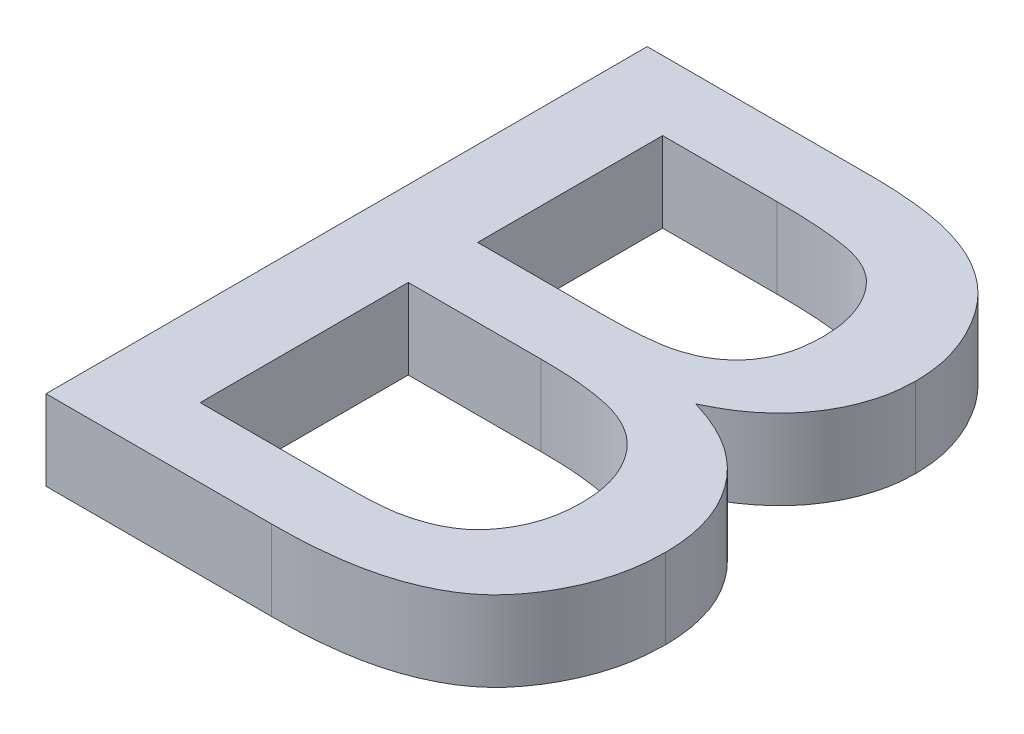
ISO-10303-21;
HEADER;
FILE_DESCRIPTION(('STEP AP214'),'2;1');
FILE_NAME('part.step','',(''),(''),'','','');
FILE_SCHEMA(('AUTOMOTIVE_DESIGN { 1 0 10303 214 1 1 1 1 }'));
ENDSEC;
DATA;
#1=APPLICATION_CONTEXT('core data for automotive mechanical design processes');
#2=APPLICATION_PROTOCOL_DEFINITION('international standard','automotive_design',2000,#1);
#3=PRODUCT_CONTEXT('',#1,'mechanical');
#4=PRODUCT('Part','Part','',(#3));
#5=PRODUCT_RELATED_PRODUCT_CATEGORY('part','',(#4));
#6=PRODUCT_DEFINITION_FORMATION('','',#4);
#7=PRODUCT_DEFINITION_CONTEXT('part definition',#1,'design');
#8=PRODUCT_DEFINITION('design','',#6,#7);
#9=PRODUCT_DEFINITION_SHAPE('','',#8);
#10=(LENGTH_UNIT() NAMED_UNIT(*) SI_UNIT(.MILLI.,.METRE.));
#11=(NAMED_UNIT(*) PLANE_ANGLE_UNIT() SI_UNIT($,.RADIAN.));
#12=(NAMED_UNIT(*) SI_UNIT($,.STERADIAN.) SOLID_ANGLE_UNIT());
#13=UNCERTAINTY_MEASURE_WITH_UNIT(LENGTH_MEASURE(1.E-05),#10,'distance_accuracy_value','');
#14=(GEOMETRIC_REPRESENTATION_CONTEXT(3) GLOBAL_UNCERTAINTY_ASSIGNED_CONTEXT((#13)) GLOBAL_UNIT_ASSIGNED_CONTEXT((#10,
#11,#12)) REPRESENTATION_CONTEXT('',''));
#15=CARTESIAN_POINT('',(0.,0.,0.));
#16=DIRECTION('',(0.,0.,1.));
#17=DIRECTION('',(1.,0.,0.));
#18=AXIS2_PLACEMENT_3D('',#15,#16,#17);
#19=CARTESIAN_POINT('',(1.90934648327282,6.60008205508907,-4.05746529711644));
#20=CARTESIAN_POINT('',(1.90934648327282,6.40008205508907,-4.05746529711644));
#21=CARTESIAN_POINT('',(1.92007446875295,6.60008205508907,-4.05758854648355));
#22=CARTESIAN_POINT('',(1.92007446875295,6.40008205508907,-4.05758854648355));
#23=CARTESIAN_POINT('',(1.93080253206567,6.60008205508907,-4.05771179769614));
#24=CARTESIAN_POINT('',(1.93080253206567,6.40008205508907,-4.05771179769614));
#25=CARTESIAN_POINT('',(1.94152982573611,6.60008205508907,-4.05788509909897));
#26=CARTESIAN_POINT('',(1.94152982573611,6.40008205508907,-4.05788509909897));
#27=CARTESIAN_POINT('',(1.95225742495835,6.60008205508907,-4.05805840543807));
#28=CARTESIAN_POINT('',(1.95225742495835,6.40008205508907,-4.05805840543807));
#29=CARTESIAN_POINT('',(1.96298587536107,6.60008205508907,-4.05825965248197));
#30=CARTESIAN_POINT('',(1.96298587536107,6.40008205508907,-4.05825965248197));
#31=CARTESIAN_POINT('',(1.97370766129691,6.60008205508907,-4.05865300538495));
#32=CARTESIAN_POINT('',(1.97370766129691,6.40008205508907,-4.05865300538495));
#33=CARTESIAN_POINT('',(1.99510234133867,6.60008205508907,-4.05943791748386));
#34=CARTESIAN_POINT('',(1.99510234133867,6.40008205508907,-4.05943791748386));
#35=CARTESIAN_POINT('',(2.0164697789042,6.60008205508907,-4.06156691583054));
#36=CARTESIAN_POINT('',(2.0164697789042,6.40008205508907,-4.06156691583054));
#37=CARTESIAN_POINT('',(2.03765177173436,6.60008205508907,-4.06467683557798));
#38=CARTESIAN_POINT('',(2.03765177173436,6.40008205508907,-4.06467683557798));
#39=(BOUNDED_SURFACE() B_SPLINE_SURFACE(3,1,((#19,#20),(#21,#22),(#23,#24),(#25,#26),(#27,#28),
(#29,#30),(#31,#32),(#33,#34),(#35,#36),(#37,#38)),.UNSPECIFIED.,.F.,.F.,
.F.) B_SPLINE_SURFACE_WITH_KNOTS((4,3,3,4),(2,2),(0.,0.250080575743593,0.500174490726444,1.),
(0.,1.),.UNSPECIFIED.) GEOMETRIC_REPRESENTATION_ITEM() RATIONAL_B_SPLINE_SURFACE(((1.,1.),(1.,
1.),(1.,1.),(1.,1.),(1.,1.),(1.,1.),(1.,1.),(1.,1.),(1.,1.),(1.,1.))) REPRESENTATION_ITEM('') SURFACE());
#40=CARTESIAN_POINT('',(1.90934648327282,6.40008205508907,-4.05746529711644));
#41=CARTESIAN_POINT('',(1.92007446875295,6.40008205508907,-4.05758854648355));
#42=CARTESIAN_POINT('',(1.93080253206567,6.40008205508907,-4.05771179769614));
#43=CARTESIAN_POINT('',(1.94152982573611,6.40008205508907,-4.05788509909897));
#44=CARTESIAN_POINT('',(1.95225742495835,6.40008205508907,-4.05805840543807));
#45=CARTESIAN_POINT('',(1.96298587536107,6.40008205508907,-4.05825965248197));
#46=CARTESIAN_POINT('',(1.97370766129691,6.40008205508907,-4.05865300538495));
#47=CARTESIAN_POINT('',(1.99510234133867,6.40008205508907,-4.05943791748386));
#48=CARTESIAN_POINT('',(2.0164697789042,6.40008205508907,-4.06156691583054));
#49=CARTESIAN_POINT('',(2.03765177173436,6.40008205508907,-4.06467683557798));
#50=(BOUNDED_CURVE() B_SPLINE_CURVE(3,(#40,#41,#42,#43,#44,#45,#46,#47,#48,#49),.UNSPECIFIED.,
.F.,.F.) B_SPLINE_CURVE_WITH_KNOTS((4,3,3,4),(0.,0.250080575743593,0.500174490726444,1.),
.UNSPECIFIED.) CURVE() GEOMETRIC_REPRESENTATION_ITEM() RATIONAL_B_SPLINE_CURVE((1.,1.,1.,1.,1.,
1.,1.,1.,1.,1.)) REPRESENTATION_ITEM(''));
#51=CARTESIAN_POINT('',(1.90934648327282,6.40008205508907,-4.05746529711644));
#52=VERTEX_POINT('',#51);
#53=CARTESIAN_POINT('',(2.03765177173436,6.40008205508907,-4.06467683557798));
#54=VERTEX_POINT('',#53);
#55=EDGE_CURVE('E204',#52,#54,#50,.T.);
#56=DIRECTION('',(0.,-1.,0.));
#57=VECTOR('',#56,1.);
#58=CARTESIAN_POINT('',(1.90934648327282,6.60008205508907,-4.05746529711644));
#59=LINE('',#58,#57);
#60=CARTESIAN_POINT('',(1.90934648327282,6.60008205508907,-4.05746529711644));
#61=VERTEX_POINT('',#60);
#62=EDGE_CURVE('E11',#61,#52,#59,.T.);
#63=CARTESIAN_POINT('',(1.90934648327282,6.60008205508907,-4.05746529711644));
#64=CARTESIAN_POINT('',(1.92007446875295,6.60008205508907,-4.05758854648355));
#65=CARTESIAN_POINT('',(1.93080253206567,6.60008205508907,-4.05771179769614));
#66=CARTESIAN_POINT('',(1.94152982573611,6.60008205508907,-4.05788509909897));
#67=CARTESIAN_POINT('',(1.95225742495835,6.60008205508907,-4.05805840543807));
#68=CARTESIAN_POINT('',(1.96298587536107,6.60008205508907,-4.05825965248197));
#69=CARTESIAN_POINT('',(1.97370766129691,6.60008205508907,-4.05865300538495));
#70=CARTESIAN_POINT('',(1.99510234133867,6.60008205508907,-4.05943791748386));
#71=CARTESIAN_POINT('',(2.0164697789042,6.60008205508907,-4.06156691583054));
#72=CARTESIAN_POINT('',(2.03765177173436,6.60008205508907,-4.06467683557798));
#73=(BOUNDED_CURVE() B_SPLINE_CURVE(3,(#63,#64,#65,#66,#67,#68,#69,#70,#71,#72),.UNSPECIFIED.,
.F.,.F.) B_SPLINE_CURVE_WITH_KNOTS((4,3,3,4),(0.,0.250080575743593,0.500174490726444,1.),
.UNSPECIFIED.) CURVE() GEOMETRIC_REPRESENTATION_ITEM() RATIONAL_B_SPLINE_CURVE((1.,1.,1.,1.,1.,
1.,1.,1.,1.,1.)) REPRESENTATION_ITEM(''));
#74=CARTESIAN_POINT('',(2.03765177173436,6.60008205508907,-4.06467683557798));
#75=VERTEX_POINT('',#74);
#76=EDGE_CURVE('E327',#61,#75,#73,.T.);
#77=DIRECTION('',(0.,-1.,0.));
#78=VECTOR('',#77,1.);
#79=CARTESIAN_POINT('',(2.03765177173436,6.60008205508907,-4.06467683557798));
#80=LINE('',#79,#78);
#81=EDGE_CURVE('E396',#75,#54,#80,.T.);
#82=ORIENTED_EDGE('',*,*,#55,.F.);
#83=ORIENTED_EDGE('',*,*,#62,.F.);
#84=ORIENTED_EDGE('',*,*,#76,.T.);
#85=ORIENTED_EDGE('',*,*,#81,.T.);
#86=EDGE_LOOP('',(#82,#83,#84,#85));
#87=FACE_BOUND('',#86,.T.);
#88=ADVANCED_FACE('F16',(#87),#39,.T.);
#89=CARTESIAN_POINT('',(0.,6.60008205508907,-4.05746529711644));
#90=DIRECTION('',(0.,0.,-1.));
#91=DIRECTION('',(0.,-1.,0.));
#92=AXIS2_PLACEMENT_3D('',#89,#90,#91);
#93=PLANE('',#92);
#94=DIRECTION('',(1.,0.,0.));
#95=VECTOR('',#94,1.);
#96=CARTESIAN_POINT('',(0.,6.40008205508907,-4.05746529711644));
#97=LINE('',#96,#95);
#98=CARTESIAN_POINT('',(1.55447869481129,6.40008205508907,-4.05746529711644));
#99=VERTEX_POINT('',#98);
#100=EDGE_CURVE('E471',#99,#52,#97,.T.);
#101=ORIENTED_EDGE('',*,*,#100,.F.);
#102=DIRECTION('',(0.,-1.,0.));
#103=VECTOR('',#102,1.);
#104=CARTESIAN_POINT('',(1.55447869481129,6.60008205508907,-4.05746529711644));
#105=LINE('',#104,#103);
#106=CARTESIAN_POINT('',(1.55447869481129,6.60008205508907,-4.05746529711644));
#107=VERTEX_POINT('',#106);
#108=EDGE_CURVE('E27',#107,#99,#105,.T.);
#109=ORIENTED_EDGE('',*,*,#108,.F.);
#110=DIRECTION('',(1.,0.,0.));
#111=VECTOR('',#110,1.);
#112=CARTESIAN_POINT('',(0.,6.60008205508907,-4.05746529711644));
#113=LINE('',#112,#111);
#114=EDGE_CURVE('E336',#107,#61,#113,.T.);
#115=ORIENTED_EDGE('',*,*,#114,.T.);
#116=ORIENTED_EDGE('',*,*,#62,.T.);
#117=EDGE_LOOP('',(#101,#109,#115,#116));
#118=FACE_BOUND('',#117,.T.);
#119=ADVANCED_FACE('F527',(#118),#93,.T.);
#120=CARTESIAN_POINT('',(1.55447869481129,6.60008205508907,0.));
#121=DIRECTION('',(1.,0.,0.));
#122=DIRECTION('',(0.,-1.,0.));
#123=AXIS2_PLACEMENT_3D('',#120,#121,#122);
#124=PLANE('',#123);
#125=DIRECTION('',(0.,0.,1.));
#126=VECTOR('',#125,1.);
#127=CARTESIAN_POINT('',(1.55447869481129,6.40008205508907,0.));
#128=LINE('',#127,#126);
#129=CARTESIAN_POINT('',(1.55447869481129,6.40008205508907,-4.57669606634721));
#130=VERTEX_POINT('',#129);
#131=EDGE_CURVE('E467',#130,#99,#128,.T.);
#132=ORIENTED_EDGE('',*,*,#131,.F.);
#133=DIRECTION('',(0.,-1.,0.));
#134=VECTOR('',#133,1.);
#135=CARTESIAN_POINT('',(1.55447869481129,6.60008205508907,-4.57669606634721));
#136=LINE('',#135,#134);
#137=CARTESIAN_POINT('',(1.55447869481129,6.60008205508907,-4.57669606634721));
#138=VERTEX_POINT('',#137);
#139=EDGE_CURVE('E21',#138,#130,#136,.T.);
#140=ORIENTED_EDGE('',*,*,#139,.F.);
#141=DIRECTION('',(0.,0.,1.));
#142=VECTOR('',#141,1.);
#143=CARTESIAN_POINT('',(1.55447869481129,6.60008205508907,0.));
#144=LINE('',#143,#142);
#145=EDGE_CURVE('E347',#138,#107,#144,.T.);
#146=ORIENTED_EDGE('',*,*,#145,.T.);
#147=ORIENTED_EDGE('',*,*,#108,.T.);
#148=EDGE_LOOP('',(#132,#140,#146,#147));
#149=FACE_BOUND('',#148,.T.);
#150=ADVANCED_FACE('F513',(#149),#124,.T.);
#151=CARTESIAN_POINT('',(0.,6.60008205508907,-4.57669606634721));
#152=DIRECTION('',(0.,0.,1.));
#153=DIRECTION('',(1.,0.,0.));
#154=AXIS2_PLACEMENT_3D('',#151,#152,#153);
#155=PLANE('',#154);
#156=DIRECTION('',(-1.,0.,0.));
#157=VECTOR('',#156,1.);
#158=CARTESIAN_POINT('',(0.,6.40008205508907,-4.57669606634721));
#159=LINE('',#158,#157);
#160=CARTESIAN_POINT('',(1.88500754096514,6.40008205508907,-4.57669606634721));
#161=VERTEX_POINT('',#160);
#162=EDGE_CURVE('E460',#161,#130,#159,.T.);
#163=ORIENTED_EDGE('',*,*,#162,.F.);
#164=DIRECTION('',(0.,-1.,0.));
#165=VECTOR('',#164,1.);
#166=CARTESIAN_POINT('',(1.88500754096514,6.60008205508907,-4.57669606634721));
#167=LINE('',#166,#165);
#168=CARTESIAN_POINT('',(1.88500754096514,6.60008205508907,-4.57669606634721));
#169=VERTEX_POINT('',#168);
#170=EDGE_CURVE('E395',#169,#161,#167,.T.);
#171=ORIENTED_EDGE('',*,*,#170,.F.);
#172=DIRECTION('',(-1.,0.,0.));
#173=VECTOR('',#172,1.);
#174=CARTESIAN_POINT('',(0.,6.60008205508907,-4.57669606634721));
#175=LINE('',#174,#173);
#176=EDGE_CURVE('E350',#169,#138,#175,.T.);
#177=ORIENTED_EDGE('',*,*,#176,.T.);
#178=ORIENTED_EDGE('',*,*,#139,.T.);
#179=EDGE_LOOP('',(#163,#171,#177,#178));
#180=FACE_BOUND('',#179,.T.);
#181=ADVANCED_FACE('F510',(#180),#155,.T.);
#182=CARTESIAN_POINT('',(2.24678638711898,6.60008205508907,-4.31708068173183));
#183=CARTESIAN_POINT('',(2.24678638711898,6.40008205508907,-4.31708068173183));
#184=CARTESIAN_POINT('',(2.24637248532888,6.60008205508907,-4.33073882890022));
#185=CARTESIAN_POINT('',(2.24637248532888,6.40008205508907,-4.33073882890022));
#186=CARTESIAN_POINT('',(2.24556533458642,6.60008205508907,-4.35737361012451));
#187=CARTESIAN_POINT('',(2.24556533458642,6.40008205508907,-4.35737361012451));
#188=CARTESIAN_POINT('',(2.23789308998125,6.60008205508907,-4.39586221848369));
#189=CARTESIAN_POINT('',(2.23789308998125,6.40008205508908,-4.39586221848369));
#190=CARTESIAN_POINT('',(2.22521979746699,6.60008205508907,-4.43156088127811));
#191=CARTESIAN_POINT('',(2.22521979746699,6.40008205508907,-4.43156088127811));
#192=CARTESIAN_POINT('',(2.20737949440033,6.60008205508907,-4.46397520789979));
#193=CARTESIAN_POINT('',(2.20737949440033,6.40008205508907,-4.46397520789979));
#194=CARTESIAN_POINT('',(2.18549743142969,6.60008205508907,-4.49312910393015));
#195=CARTESIAN_POINT('',(2.18549743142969,6.40008205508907,-4.49312910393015));
#196=CARTESIAN_POINT('',(2.1590223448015,6.60008205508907,-4.5178595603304));
#197=CARTESIAN_POINT('',(2.1590223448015,6.40008205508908,-4.5178595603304));
#198=CARTESIAN_POINT('',(2.12815219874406,6.60008205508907,-4.53748440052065));
#199=CARTESIAN_POINT('',(2.12815219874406,6.40008205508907,-4.53748440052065));
#200=CARTESIAN_POINT('',(2.0927921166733,6.60008205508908,-4.55288610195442));
#201=CARTESIAN_POINT('',(2.0927921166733,6.40008205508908,-4.55288610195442));
#202=CARTESIAN_POINT('',(2.05146326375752,6.60008205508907,-4.56384414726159));
#203=CARTESIAN_POINT('',(2.05146326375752,6.40008205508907,-4.56384414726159));
#204=CARTESIAN_POINT('',(2.00302463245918,6.60008205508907,-4.57127851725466));
#205=CARTESIAN_POINT('',(2.00302463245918,6.40008205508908,-4.57127851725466));
#206=CARTESIAN_POINT('',(1.94670143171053,6.60008205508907,-4.57607573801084));
#207=CARTESIAN_POINT('',(1.94670143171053,6.40008205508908,-4.57607573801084));
#208=CARTESIAN_POINT('',(1.90645296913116,6.60008205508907,-4.57648043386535));
#209=CARTESIAN_POINT('',(1.90645296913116,6.40008205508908,-4.57648043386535));
#210=CARTESIAN_POINT('',(1.88500754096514,6.60008205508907,-4.57669606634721));
#211=CARTESIAN_POINT('',(1.88500754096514,6.40008205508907,-4.57669606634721));
#212=(BOUNDED_SURFACE() B_SPLINE_SURFACE(3,1,((#182,#183),(#184,#185),(#186,#187),(#188,#189),
(#190,#191),(#192,#193),(#194,#195),(#196,#197),(#198,#199),(#200,#201),(#202,#203),(#204,#205),
(#206,#207),(#208,#209),(#210,#211)),.UNSPECIFIED.,.F.,.F.,.F.) B_SPLINE_SURFACE_WITH_KNOTS((4,
1,1,1,1,1,1,1,1,1,1,1,4),(2,2),(0.,0.0801399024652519,0.156280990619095,0.229406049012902,
0.301798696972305,0.372742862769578,0.442667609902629,0.513320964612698,0.586547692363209,
0.668322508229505,0.763676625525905,0.874080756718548,1.),(0.,1.),
.UNSPECIFIED.) GEOMETRIC_REPRESENTATION_ITEM() RATIONAL_B_SPLINE_SURFACE(((1.,1.),(1.,1.),(1.,
1.),(1.,1.),(1.,1.),(1.,1.),(1.,1.),(1.,1.),(1.,1.),(1.,1.),(1.,1.),(1.,1.),(1.,1.),(1.,1.),(1.,1.))) REPRESENTATION_ITEM('') SURFACE());
#213=CARTESIAN_POINT('',(2.24678638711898,6.40008205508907,-4.31708068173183));
#214=CARTESIAN_POINT('',(2.24637248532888,6.40008205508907,-4.33073882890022));
#215=CARTESIAN_POINT('',(2.24556533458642,6.40008205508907,-4.35737361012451));
#216=CARTESIAN_POINT('',(2.23789308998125,6.40008205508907,-4.39586221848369));
#217=CARTESIAN_POINT('',(2.22521979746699,6.40008205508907,-4.43156088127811));
#218=CARTESIAN_POINT('',(2.20737949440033,6.40008205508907,-4.46397520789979));
#219=CARTESIAN_POINT('',(2.18549743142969,6.40008205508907,-4.49312910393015));
#220=CARTESIAN_POINT('',(2.1590223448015,6.40008205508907,-4.5178595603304));
#221=CARTESIAN_POINT('',(2.12815219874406,6.40008205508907,-4.53748440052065));
#222=CARTESIAN_POINT('',(2.0927921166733,6.40008205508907,-4.55288610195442));
#223=CARTESIAN_POINT('',(2.05146326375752,6.40008205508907,-4.56384414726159));
#224=CARTESIAN_POINT('',(2.00302463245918,6.40008205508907,-4.57127851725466));
#225=CARTESIAN_POINT('',(1.94670143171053,6.40008205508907,-4.57607573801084));
#226=CARTESIAN_POINT('',(1.90645296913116,6.40008205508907,-4.57648043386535));
#227=CARTESIAN_POINT('',(1.88500754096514,6.40008205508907,-4.57669606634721));
#228=(BOUNDED_CURVE() B_SPLINE_CURVE(3,(#213,#214,#215,#216,#217,#218,#219,#220,#221,#222,#223,
#224,#225,#226,#227),.UNSPECIFIED.,.F.,.F.) B_SPLINE_CURVE_WITH_KNOTS((4,1,1,1,1,1,1,1,1,1,1,1,
4),(0.,0.0801399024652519,0.156280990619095,0.229406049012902,0.301798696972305,
0.372742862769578,0.442667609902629,0.513320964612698,0.586547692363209,0.668322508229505,
0.763676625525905,0.874080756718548,1.),
.UNSPECIFIED.) CURVE() GEOMETRIC_REPRESENTATION_ITEM() RATIONAL_B_SPLINE_CURVE((1.,1.,1.,1.,1.,
1.,1.,1.,1.,1.,1.,1.,1.,1.,1.)) REPRESENTATION_ITEM(''));
#229=CARTESIAN_POINT('',(2.24678638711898,6.40008205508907,-4.31708068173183));
#230=VERTEX_POINT('',#229);
#231=EDGE_CURVE('E451',#230,#161,#228,.T.);
#232=DIRECTION('',(0.,-1.,0.));
#233=VECTOR('',#232,1.);
#234=CARTESIAN_POINT('',(2.24678638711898,6.60008205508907,-4.31708068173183));
#235=LINE('',#234,#233);
#236=CARTESIAN_POINT('',(2.24678638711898,6.60008205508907,-4.31708068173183));
#237=VERTEX_POINT('',#236);
#238=EDGE_CURVE('E389',#237,#230,#235,.T.);
#239=CARTESIAN_POINT('',(2.24678638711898,6.60008205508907,-4.31708068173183));
#240=CARTESIAN_POINT('',(2.24637248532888,6.60008205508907,-4.33073882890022));
#241=CARTESIAN_POINT('',(2.24556533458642,6.60008205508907,-4.35737361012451));
#242=CARTESIAN_POINT('',(2.23789308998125,6.60008205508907,-4.39586221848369));
#243=CARTESIAN_POINT('',(2.22521979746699,6.60008205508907,-4.43156088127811));
#244=CARTESIAN_POINT('',(2.20737949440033,6.60008205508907,-4.46397520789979));
#245=CARTESIAN_POINT('',(2.18549743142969,6.60008205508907,-4.49312910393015));
#246=CARTESIAN_POINT('',(2.1590223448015,6.60008205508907,-4.5178595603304));
#247=CARTESIAN_POINT('',(2.12815219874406,6.60008205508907,-4.53748440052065));
#248=CARTESIAN_POINT('',(2.0927921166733,6.60008205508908,-4.55288610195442));
#249=CARTESIAN_POINT('',(2.05146326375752,6.60008205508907,-4.56384414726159));
#250=CARTESIAN_POINT('',(2.00302463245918,6.60008205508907,-4.57127851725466));
#251=CARTESIAN_POINT('',(1.94670143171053,6.60008205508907,-4.57607573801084));
#252=CARTESIAN_POINT('',(1.90645296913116,6.60008205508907,-4.57648043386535));
#253=CARTESIAN_POINT('',(1.88500754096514,6.60008205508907,-4.57669606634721));
#254=(BOUNDED_CURVE() B_SPLINE_CURVE(3,(#239,#240,#241,#242,#243,#244,#245,#246,#247,#248,#249,
#250,#251,#252,#253),.UNSPECIFIED.,.F.,.F.) B_SPLINE_CURVE_WITH_KNOTS((4,1,1,1,1,1,1,1,1,1,1,1,
4),(0.,0.0801399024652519,0.156280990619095,0.229406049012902,0.301798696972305,
0.372742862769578,0.442667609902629,0.513320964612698,0.586547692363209,0.668322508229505,
0.763676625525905,0.874080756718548,1.),
.UNSPECIFIED.) CURVE() GEOMETRIC_REPRESENTATION_ITEM() RATIONAL_B_SPLINE_CURVE((1.,1.,1.,1.,1.,
1.,1.,1.,1.,1.,1.,1.,1.,1.,1.)) REPRESENTATION_ITEM(''));
#255=EDGE_CURVE('E285',#237,#169,#254,.T.);
#256=ORIENTED_EDGE('',*,*,#231,.F.);
#257=ORIENTED_EDGE('',*,*,#238,.F.);
#258=ORIENTED_EDGE('',*,*,#255,.T.);
#259=ORIENTED_EDGE('',*,*,#170,.T.);
#260=EDGE_LOOP('',(#256,#257,#258,#259));
#261=FACE_BOUND('',#260,.T.);
#262=ADVANCED_FACE('F518',(#261),#212,.T.);
#263=CARTESIAN_POINT('',(2.03765177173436,6.60008205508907,-4.06467683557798));
#264=CARTESIAN_POINT('',(2.03765177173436,6.40008205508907,-4.06467683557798));
#265=CARTESIAN_POINT('',(2.04812209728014,6.60008205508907,-4.06687759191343));
#266=CARTESIAN_POINT('',(2.04812209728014,6.40008205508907,-4.06687759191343));
#267=CARTESIAN_POINT('',(2.06839535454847,6.60008205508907,-4.07113882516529));
#268=CARTESIAN_POINT('',(2.06839535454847,6.40008205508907,-4.07113882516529));
#269=CARTESIAN_POINT('',(2.09697578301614,6.60008205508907,-4.08064945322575));
#270=CARTESIAN_POINT('',(2.09697578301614,6.40008205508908,-4.08064945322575));
#271=CARTESIAN_POINT('',(2.12318042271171,6.60008205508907,-4.09154438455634));
#272=CARTESIAN_POINT('',(2.12318042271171,6.40008205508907,-4.09154438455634));
#273=CARTESIAN_POINT('',(2.14655191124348,6.60008205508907,-4.10539063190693));
#274=CARTESIAN_POINT('',(2.14655191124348,6.40008205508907,-4.10539063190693));
#275=CARTESIAN_POINT('',(2.1681933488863,6.60008205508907,-4.12134748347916));
#276=CARTESIAN_POINT('',(2.1681933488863,6.40008205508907,-4.12134748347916));
#277=CARTESIAN_POINT('',(2.18700136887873,6.60008205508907,-4.14127835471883));
#278=CARTESIAN_POINT('',(2.18700136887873,6.40008205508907,-4.14127835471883));
#279=CARTESIAN_POINT('',(2.20432444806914,6.60008205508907,-4.16392319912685));
#280=CARTESIAN_POINT('',(2.20432444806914,6.40008205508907,-4.16392319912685));
#281=CARTESIAN_POINT('',(2.21933337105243,6.60008205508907,-4.18983764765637));
#282=CARTESIAN_POINT('',(2.21933337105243,6.40008205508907,-4.18983764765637));
#283=CARTESIAN_POINT('',(2.23147026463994,6.60008205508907,-4.21850593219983));
#284=CARTESIAN_POINT('',(2.23147026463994,6.40008205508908,-4.21850593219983));
#285=CARTESIAN_POINT('',(2.24074628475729,6.60008205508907,-4.2494851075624));
#286=CARTESIAN_POINT('',(2.24074628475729,6.40008205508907,-4.2494851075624));
#287=CARTESIAN_POINT('',(2.24568736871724,6.60008205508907,-4.28266655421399));
#288=CARTESIAN_POINT('',(2.24568736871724,6.40008205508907,-4.28266655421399));
#289=CARTESIAN_POINT('',(2.24641487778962,6.60008205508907,-4.30544741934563));
#290=CARTESIAN_POINT('',(2.24641487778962,6.40008205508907,-4.30544741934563));
#291=CARTESIAN_POINT('',(2.24678638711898,6.60008205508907,-4.31708068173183));
#292=CARTESIAN_POINT('',(2.24678638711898,6.40008205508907,-4.31708068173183));
#293=(BOUNDED_SURFACE() B_SPLINE_SURFACE(3,1,((#263,#264),(#265,#266),(#267,#268),(#269,#270),
(#271,#272),(#273,#274),(#275,#276),(#277,#278),(#279,#280),(#281,#282),(#283,#284),(#285,#286),
(#287,#288),(#289,#290),(#291,#292)),.UNSPECIFIED.,.F.,.F.,.F.) B_SPLINE_SURFACE_WITH_KNOTS((4,
1,1,1,1,1,1,1,1,1,1,1,4),(2,2),(0.,0.0889709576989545,0.172270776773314,0.25031203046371,
0.324655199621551,0.397844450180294,0.473300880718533,0.551825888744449,0.634749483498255,
0.721766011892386,0.81039266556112,0.90317523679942,1.),(0.,1.),
.UNSPECIFIED.) GEOMETRIC_REPRESENTATION_ITEM() RATIONAL_B_SPLINE_SURFACE(((1.,1.),(1.,1.),(1.,
1.),(1.,1.),(1.,1.),(1.,1.),(1.,1.),(1.,1.),(1.,1.),(1.,1.),(1.,1.),(1.,1.),(1.,1.),(1.,1.),(1.,1.))) REPRESENTATION_ITEM('') SURFACE());
#294=CARTESIAN_POINT('',(2.03765177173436,6.40008205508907,-4.06467683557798));
#295=CARTESIAN_POINT('',(2.04812209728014,6.40008205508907,-4.06687759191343));
#296=CARTESIAN_POINT('',(2.06839535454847,6.40008205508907,-4.07113882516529));
#297=CARTESIAN_POINT('',(2.09697578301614,6.40008205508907,-4.08064945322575));
#298=CARTESIAN_POINT('',(2.12318042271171,6.40008205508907,-4.09154438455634));
#299=CARTESIAN_POINT('',(2.14655191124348,6.40008205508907,-4.10539063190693));
#300=CARTESIAN_POINT('',(2.1681933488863,6.40008205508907,-4.12134748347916));
#301=CARTESIAN_POINT('',(2.18700136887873,6.40008205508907,-4.14127835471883));
#302=CARTESIAN_POINT('',(2.20432444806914,6.40008205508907,-4.16392319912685));
#303=CARTESIAN_POINT('',(2.21933337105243,6.40008205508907,-4.18983764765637));
#304=CARTESIAN_POINT('',(2.23147026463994,6.40008205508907,-4.21850593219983));
#305=CARTESIAN_POINT('',(2.24074628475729,6.40008205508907,-4.2494851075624));
#306=CARTESIAN_POINT('',(2.24568736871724,6.40008205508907,-4.28266655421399));
#307=CARTESIAN_POINT('',(2.24641487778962,6.40008205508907,-4.30544741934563));
#308=CARTESIAN_POINT('',(2.24678638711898,6.40008205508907,-4.31708068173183));
#309=(BOUNDED_CURVE() B_SPLINE_CURVE(3,(#294,#295,#296,#297,#298,#299,#300,#301,#302,#303,#304,
#305,#306,#307,#308),.UNSPECIFIED.,.F.,.F.) B_SPLINE_CURVE_WITH_KNOTS((4,1,1,1,1,1,1,1,1,1,1,1,
4),(0.,0.0889709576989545,0.172270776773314,0.25031203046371,0.324655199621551,
0.397844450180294,0.473300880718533,0.551825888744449,0.634749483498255,0.721766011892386,
0.81039266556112,0.90317523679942,1.),
.UNSPECIFIED.) CURVE() GEOMETRIC_REPRESENTATION_ITEM() RATIONAL_B_SPLINE_CURVE((1.,1.,1.,1.,1.,
1.,1.,1.,1.,1.,1.,1.,1.,1.,1.)) REPRESENTATION_ITEM(''));
#310=EDGE_CURVE('E442',#54,#230,#309,.T.);
#311=CARTESIAN_POINT('',(2.03765177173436,6.60008205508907,-4.06467683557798));
#312=CARTESIAN_POINT('',(2.04812209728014,6.60008205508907,-4.06687759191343));
#313=CARTESIAN_POINT('',(2.06839535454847,6.60008205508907,-4.07113882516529));
#314=CARTESIAN_POINT('',(2.09697578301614,6.60008205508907,-4.08064945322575));
#315=CARTESIAN_POINT('',(2.12318042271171,6.60008205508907,-4.09154438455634));
#316=CARTESIAN_POINT('',(2.14655191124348,6.60008205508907,-4.10539063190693));
#317=CARTESIAN_POINT('',(2.1681933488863,6.60008205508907,-4.12134748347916));
#318=CARTESIAN_POINT('',(2.18700136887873,6.60008205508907,-4.14127835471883));
#319=CARTESIAN_POINT('',(2.20432444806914,6.60008205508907,-4.16392319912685));
#320=CARTESIAN_POINT('',(2.21933337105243,6.60008205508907,-4.18983764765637));
#321=CARTESIAN_POINT('',(2.23147026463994,6.60008205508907,-4.21850593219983));
#322=CARTESIAN_POINT('',(2.24074628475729,6.60008205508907,-4.2494851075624));
#323=CARTESIAN_POINT('',(2.24568736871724,6.60008205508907,-4.28266655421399));
#324=CARTESIAN_POINT('',(2.24641487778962,6.60008205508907,-4.30544741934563));
#325=CARTESIAN_POINT('',(2.24678638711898,6.60008205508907,-4.31708068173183));
#326=(BOUNDED_CURVE() B_SPLINE_CURVE(3,(#311,#312,#313,#314,#315,#316,#317,#318,#319,#320,#321,
#322,#323,#324,#325),.UNSPECIFIED.,.F.,.F.) B_SPLINE_CURVE_WITH_KNOTS((4,1,1,1,1,1,1,1,1,1,1,1,
4),(0.,0.0889709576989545,0.172270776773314,0.25031203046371,0.324655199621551,
0.397844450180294,0.473300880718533,0.551825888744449,0.634749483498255,0.721766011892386,
0.81039266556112,0.90317523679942,1.),
.UNSPECIFIED.) CURVE() GEOMETRIC_REPRESENTATION_ITEM() RATIONAL_B_SPLINE_CURVE((1.,1.,1.,1.,1.,
1.,1.,1.,1.,1.,1.,1.,1.,1.,1.)) REPRESENTATION_ITEM(''));
#327=EDGE_CURVE('E303',#75,#237,#326,.T.);
#328=ORIENTED_EDGE('',*,*,#310,.F.);
#329=ORIENTED_EDGE('',*,*,#81,.F.);
#330=ORIENTED_EDGE('',*,*,#327,.T.);
#331=ORIENTED_EDGE('',*,*,#238,.T.);
#332=EDGE_LOOP('',(#328,#329,#330,#331));
#333=FACE_BOUND('',#332,.T.);
#334=ADVANCED_FACE('F522',(#333),#293,.T.);
#335=CARTESIAN_POINT('',(1.86367340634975,6.60008205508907,-4.74977298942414));
#336=CARTESIAN_POINT('',(1.86367340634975,6.40008205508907,-4.74977298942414));
#337=CARTESIAN_POINT('',(1.87379102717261,6.60008205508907,-4.74981301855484));
#338=CARTESIAN_POINT('',(1.87379102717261,6.40008205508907,-4.74981301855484));
#339=CARTESIAN_POINT('',(1.89322926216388,6.60008205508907,-4.74988992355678));
#340=CARTESIAN_POINT('',(1.89322926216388,6.40008205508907,-4.74988992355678));
#341=CARTESIAN_POINT('',(1.92126845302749,6.60008205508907,-4.75096220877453));
#342=CARTESIAN_POINT('',(1.92126845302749,6.40008205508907,-4.75096220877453));
#343=CARTESIAN_POINT('',(1.94714728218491,6.60008205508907,-4.75187702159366));
#344=CARTESIAN_POINT('',(1.94714728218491,6.40008205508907,-4.75187702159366));
#345=CARTESIAN_POINT('',(1.97076564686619,6.60008205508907,-4.75417313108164));
#346=CARTESIAN_POINT('',(1.97076564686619,6.40008205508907,-4.75417313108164));
#347=CARTESIAN_POINT('',(1.99224055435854,6.60008205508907,-4.75642206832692));
#348=CARTESIAN_POINT('',(1.99224055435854,6.40008205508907,-4.75642206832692));
#349=CARTESIAN_POINT('',(2.01148606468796,6.60008205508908,-4.75944948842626));
#350=CARTESIAN_POINT('',(2.01148606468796,6.40008205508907,-4.75944948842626));
#351=CARTESIAN_POINT('',(2.02859644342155,6.60008205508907,-4.76286070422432));
#352=CARTESIAN_POINT('',(2.02859644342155,6.40008205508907,-4.76286070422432));
#353=CARTESIAN_POINT('',(2.03907313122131,6.60008205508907,-4.7660248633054));
#354=CARTESIAN_POINT('',(2.03907313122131,6.40008205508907,-4.7660248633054));
#355=CARTESIAN_POINT('',(2.04396186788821,6.60008205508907,-4.76750135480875));
#356=CARTESIAN_POINT('',(2.04396186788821,6.40008205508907,-4.76750135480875));
#357=(BOUNDED_SURFACE() B_SPLINE_SURFACE(3,1,((#335,#336),(#337,#338),(#339,#340),(#341,#342),
(#343,#344),(#345,#346),(#347,#348),(#349,#350),(#351,#352),(#353,#354),(#355,#356)),
.UNSPECIFIED.,.F.,.F.,.F.) B_SPLINE_SURFACE_WITH_KNOTS((4,1,1,1,1,1,1,1,4),(2,2),(0.,
0.16698017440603,0.320806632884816,0.463134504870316,0.59424805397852,0.712367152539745,
0.819454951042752,0.915752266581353,1.),(0.,1.),
.UNSPECIFIED.) GEOMETRIC_REPRESENTATION_ITEM() RATIONAL_B_SPLINE_SURFACE(((1.,1.),(1.,1.),(1.,
1.),(1.,1.),(1.,1.),(1.,1.),(1.,1.),(1.,1.),(1.,1.),(1.,1.),(1.,1.))) REPRESENTATION_ITEM('') SURFACE());
#358=CARTESIAN_POINT('',(1.86367340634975,6.40008205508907,-4.74977298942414));
#359=CARTESIAN_POINT('',(1.87379102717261,6.40008205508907,-4.74981301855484));
#360=CARTESIAN_POINT('',(1.89322926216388,6.40008205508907,-4.74988992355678));
#361=CARTESIAN_POINT('',(1.92126845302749,6.40008205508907,-4.75096220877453));
#362=CARTESIAN_POINT('',(1.94714728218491,6.40008205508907,-4.75187702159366));
#363=CARTESIAN_POINT('',(1.97076564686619,6.40008205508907,-4.75417313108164));
#364=CARTESIAN_POINT('',(1.99224055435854,6.40008205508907,-4.75642206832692));
#365=CARTESIAN_POINT('',(2.01148606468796,6.40008205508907,-4.75944948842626));
#366=CARTESIAN_POINT('',(2.02859644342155,6.40008205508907,-4.76286070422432));
#367=CARTESIAN_POINT('',(2.03907313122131,6.40008205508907,-4.7660248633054));
#368=CARTESIAN_POINT('',(2.04396186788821,6.40008205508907,-4.76750135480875));
#369=(BOUNDED_CURVE() B_SPLINE_CURVE(3,(#358,#359,#360,#361,#362,#363,#364,#365,#366,#367,#368),
.UNSPECIFIED.,.F.,.F.) B_SPLINE_CURVE_WITH_KNOTS((4,1,1,1,1,1,1,1,4),(0.,0.16698017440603,
0.320806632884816,0.463134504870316,0.59424805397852,0.712367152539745,0.819454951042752,
0.915752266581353,1.),
.UNSPECIFIED.) CURVE() GEOMETRIC_REPRESENTATION_ITEM() RATIONAL_B_SPLINE_CURVE((1.,1.,1.,1.,1.,
1.,1.,1.,1.,1.,1.)) REPRESENTATION_ITEM(''));
#370=CARTESIAN_POINT('',(1.86367340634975,6.40008205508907,-4.74977298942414));
#371=VERTEX_POINT('',#370);
#372=CARTESIAN_POINT('',(2.04396186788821,6.40008205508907,-4.76750135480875));
#373=VERTEX_POINT('',#372);
#374=EDGE_CURVE('E436',#371,#373,#369,.T.);
#375=DIRECTION('',(0.,-1.,0.));
#376=VECTOR('',#375,1.);
#377=CARTESIAN_POINT('',(1.86367340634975,6.60008205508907,-4.74977298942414));
#378=LINE('',#377,#376);
#379=CARTESIAN_POINT('',(1.86367340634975,6.60008205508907,-4.74977298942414));
#380=VERTEX_POINT('',#379);
#381=EDGE_CURVE('E497',#380,#371,#378,.T.);
#382=CARTESIAN_POINT('',(1.86367340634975,6.60008205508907,-4.74977298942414));
#383=CARTESIAN_POINT('',(1.87379102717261,6.60008205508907,-4.74981301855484));
#384=CARTESIAN_POINT('',(1.89322926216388,6.60008205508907,-4.74988992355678));
#385=CARTESIAN_POINT('',(1.92126845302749,6.60008205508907,-4.75096220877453));
#386=CARTESIAN_POINT('',(1.94714728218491,6.60008205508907,-4.75187702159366));
#387=CARTESIAN_POINT('',(1.97076564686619,6.60008205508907,-4.75417313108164));
#388=CARTESIAN_POINT('',(1.99224055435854,6.60008205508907,-4.75642206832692));
#389=CARTESIAN_POINT('',(2.01148606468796,6.60008205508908,-4.75944948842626));
#390=CARTESIAN_POINT('',(2.02859644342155,6.60008205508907,-4.76286070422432));
#391=CARTESIAN_POINT('',(2.03907313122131,6.60008205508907,-4.7660248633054));
#392=CARTESIAN_POINT('',(2.04396186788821,6.60008205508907,-4.76750135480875));
#393=(BOUNDED_CURVE() B_SPLINE_CURVE(3,(#382,#383,#384,#385,#386,#387,#388,#389,#390,#391,#392),
.UNSPECIFIED.,.F.,.F.) B_SPLINE_CURVE_WITH_KNOTS((4,1,1,1,1,1,1,1,4),(0.,0.16698017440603,
0.320806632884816,0.463134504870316,0.59424805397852,0.712367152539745,0.819454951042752,
0.915752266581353,1.),
.UNSPECIFIED.) CURVE() GEOMETRIC_REPRESENTATION_ITEM() RATIONAL_B_SPLINE_CURVE((1.,1.,1.,1.,1.,
1.,1.,1.,1.,1.,1.)) REPRESENTATION_ITEM(''));
#394=CARTESIAN_POINT('',(2.04396186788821,6.60008205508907,-4.76750135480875));
#395=VERTEX_POINT('',#394);
#396=EDGE_CURVE('E294',#380,#395,#393,.T.);
#397=DIRECTION('',(0.,-1.,0.));
#398=VECTOR('',#397,1.);
#399=CARTESIAN_POINT('',(2.04396186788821,6.60008205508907,-4.76750135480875));
#400=LINE('',#399,#398);
#401=EDGE_CURVE('E276',#395,#373,#400,.T.);
#402=ORIENTED_EDGE('',*,*,#374,.F.);
#403=ORIENTED_EDGE('',*,*,#381,.F.);
#404=ORIENTED_EDGE('',*,*,#396,.T.);
#405=ORIENTED_EDGE('',*,*,#401,.T.);
#406=EDGE_LOOP('',(#402,#403,#404,#405));
#407=FACE_BOUND('',#406,.T.);
#408=ADVANCED_FACE('F545',(#407),#357,.T.);
#409=CARTESIAN_POINT('',(0.,6.60008205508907,-4.74977298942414));
#410=DIRECTION('',(0.,0.,-1.));
#411=DIRECTION('',(0.,-1.,0.));
#412=AXIS2_PLACEMENT_3D('',#409,#410,#411);
#413=PLANE('',#412);
#414=DIRECTION('',(1.,0.,0.));
#415=VECTOR('',#414,1.);
#416=CARTESIAN_POINT('',(0.,6.40008205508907,-4.74977298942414));
#417=LINE('',#416,#415);
#418=CARTESIAN_POINT('',(1.55447869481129,6.40008205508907,-4.74977298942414));
#419=VERTEX_POINT('',#418);
#420=EDGE_CURVE('E432',#419,#371,#417,.T.);
#421=ORIENTED_EDGE('',*,*,#420,.F.);
#422=DIRECTION('',(0.,-1.,0.));
#423=VECTOR('',#422,1.);
#424=CARTESIAN_POINT('',(1.55447869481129,6.60008205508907,-4.74977298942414));
#425=LINE('',#424,#423);
#426=CARTESIAN_POINT('',(1.55447869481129,6.60008205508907,-4.74977298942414));
#427=VERTEX_POINT('',#426);
#428=EDGE_CURVE('E237',#427,#419,#425,.T.);
#429=ORIENTED_EDGE('',*,*,#428,.F.);
#430=DIRECTION('',(1.,0.,0.));
#431=VECTOR('',#430,1.);
#432=CARTESIAN_POINT('',(0.,6.60008205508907,-4.74977298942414));
#433=LINE('',#432,#431);
#434=EDGE_CURVE('E312',#427,#380,#433,.T.);
#435=ORIENTED_EDGE('',*,*,#434,.T.);
#436=ORIENTED_EDGE('',*,*,#381,.T.);
#437=EDGE_LOOP('',(#421,#429,#435,#436));
#438=FACE_BOUND('',#437,.T.);
#439=ADVANCED_FACE('F555',(#438),#413,.T.);
#440=CARTESIAN_POINT('',(1.55447869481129,6.60008205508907,0.));
#441=DIRECTION('',(1.,0.,0.));
#442=DIRECTION('',(0.,-1.,0.));
#443=AXIS2_PLACEMENT_3D('',#440,#441,#442);
#444=PLANE('',#443);
#445=DIRECTION('',(0.,0.,1.));
#446=VECTOR('',#445,1.);
#447=CARTESIAN_POINT('',(1.55447869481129,6.40008205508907,0.));
#448=LINE('',#447,#446);
#449=CARTESIAN_POINT('',(1.55447869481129,6.40008205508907,-5.2113114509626));
#450=VERTEX_POINT('',#449);
#451=EDGE_CURVE('E426',#450,#419,#448,.T.);
#452=ORIENTED_EDGE('',*,*,#451,.F.);
#453=DIRECTION('',(0.,-1.,0.));
#454=VECTOR('',#453,1.);
#455=CARTESIAN_POINT('',(1.55447869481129,6.60008205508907,-5.2113114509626));
#456=LINE('',#455,#454);
#457=CARTESIAN_POINT('',(1.55447869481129,6.60008205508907,-5.2113114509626));
#458=VERTEX_POINT('',#457);
#459=EDGE_CURVE('E235',#458,#450,#456,.T.);
#460=ORIENTED_EDGE('',*,*,#459,.F.);
#461=DIRECTION('',(0.,0.,1.));
#462=VECTOR('',#461,1.);
#463=CARTESIAN_POINT('',(1.55447869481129,6.60008205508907,0.));
#464=LINE('',#463,#462);
#465=EDGE_CURVE('E286',#458,#427,#464,.T.);
#466=ORIENTED_EDGE('',*,*,#465,.T.);
#467=ORIENTED_EDGE('',*,*,#428,.T.);
#468=EDGE_LOOP('',(#452,#460,#466,#467));
#469=FACE_BOUND('',#468,.T.);
#470=ADVANCED_FACE('F564',(#469),#444,.T.);
#471=CARTESIAN_POINT('',(0.,6.60008205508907,-5.2113114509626));
#472=DIRECTION('',(0.,0.,1.));
#473=DIRECTION('',(1.,0.,0.));
#474=AXIS2_PLACEMENT_3D('',#471,#472,#473);
#475=PLANE('',#474);
#476=DIRECTION('',(-1.,0.,0.));
#477=VECTOR('',#476,1.);
#478=CARTESIAN_POINT('',(0.,6.40008205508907,-5.2113114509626));
#479=LINE('',#478,#477);
#480=CARTESIAN_POINT('',(1.84023590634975,6.40008205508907,-5.2113114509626));
#481=VERTEX_POINT('',#480);
#482=EDGE_CURVE('E419',#481,#450,#479,.T.);
#483=ORIENTED_EDGE('',*,*,#482,.F.);
#484=DIRECTION('',(0.,-1.,0.));
#485=VECTOR('',#484,1.);
#486=CARTESIAN_POINT('',(1.84023590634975,6.60008205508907,-5.2113114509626));
#487=LINE('',#486,#485);
#488=CARTESIAN_POINT('',(1.84023590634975,6.60008205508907,-5.2113114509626));
#489=VERTEX_POINT('',#488);
#490=EDGE_CURVE('E238',#489,#481,#487,.T.);
#491=ORIENTED_EDGE('',*,*,#490,.F.);
#492=DIRECTION('',(-1.,0.,0.));
#493=VECTOR('',#492,1.);
#494=CARTESIAN_POINT('',(0.,6.60008205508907,-5.2113114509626));
#495=LINE('',#494,#493);
#496=EDGE_CURVE('E281',#489,#458,#495,.T.);
#497=ORIENTED_EDGE('',*,*,#496,.T.);
#498=ORIENTED_EDGE('',*,*,#459,.T.);
#499=EDGE_LOOP('',(#483,#491,#497,#498));
#500=FACE_BOUND('',#499,.T.);
#501=ADVANCED_FACE('F568',(#500),#475,.T.);
#502=CARTESIAN_POINT('',(2.18909407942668,6.60008205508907,-4.9769364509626));
#503=CARTESIAN_POINT('',(2.18909407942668,6.40008205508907,-4.9769364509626));
#504=CARTESIAN_POINT('',(2.18870575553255,6.60008205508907,-4.98928204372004));
#505=CARTESIAN_POINT('',(2.18870575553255,6.40008205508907,-4.98928204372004));
#506=CARTESIAN_POINT('',(2.18794895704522,6.60008205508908,-5.01334218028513));
#507=CARTESIAN_POINT('',(2.18794895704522,6.40008205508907,-5.01334218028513));
#508=CARTESIAN_POINT('',(2.18159631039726,6.60008205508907,-5.04828167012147));
#509=CARTESIAN_POINT('',(2.18159631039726,6.40008205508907,-5.04828167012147));
#510=CARTESIAN_POINT('',(2.17060329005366,6.60008205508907,-5.08078644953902));
#511=CARTESIAN_POINT('',(2.17060329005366,6.40008205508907,-5.08078644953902));
#512=CARTESIAN_POINT('',(2.1557157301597,6.60008205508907,-5.11084938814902));
#513=CARTESIAN_POINT('',(2.1557157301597,6.40008205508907,-5.11084938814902));
#514=CARTESIAN_POINT('',(2.13686412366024,6.60008205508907,-5.13759468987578));
#515=CARTESIAN_POINT('',(2.13686412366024,6.40008205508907,-5.13759468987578));
#516=CARTESIAN_POINT('',(2.11436407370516,6.60008205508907,-5.16058938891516));
#517=CARTESIAN_POINT('',(2.11436407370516,6.40008205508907,-5.16058938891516));
#518=CARTESIAN_POINT('',(2.08741060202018,6.60008205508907,-5.17797236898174));
#519=CARTESIAN_POINT('',(2.08741060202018,6.40008205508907,-5.17797236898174));
#520=CARTESIAN_POINT('',(2.06221717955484,6.60008205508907,-5.18881590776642));
#521=CARTESIAN_POINT('',(2.06221717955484,6.40008205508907,-5.18881590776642));
#522=CARTESIAN_POINT('',(2.03955769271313,6.60008205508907,-5.19559956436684));
#523=CARTESIAN_POINT('',(2.03955769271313,6.40008205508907,-5.19559956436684));
#524=CARTESIAN_POINT('',(2.01931223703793,6.60008205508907,-5.19961317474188));
#525=CARTESIAN_POINT('',(2.01931223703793,6.40008205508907,-5.19961317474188));
#526=CARTESIAN_POINT('',(1.99634785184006,6.60008205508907,-5.20314956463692));
#527=CARTESIAN_POINT('',(1.99634785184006,6.40008205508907,-5.20314956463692));
#528=CARTESIAN_POINT('',(1.97058896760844,6.60008205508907,-5.20615608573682));
#529=CARTESIAN_POINT('',(1.97058896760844,6.40008205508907,-5.20615608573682));
#530=CARTESIAN_POINT('',(1.9420258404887,6.60008205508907,-5.20848942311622));
#531=CARTESIAN_POINT('',(1.9420258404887,6.40008205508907,-5.20848942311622));
#532=CARTESIAN_POINT('',(1.91057046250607,6.60008205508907,-5.21034310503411));
#533=CARTESIAN_POINT('',(1.91057046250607,6.40008205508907,-5.21034310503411));
#534=CARTESIAN_POINT('',(1.87629771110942,6.60008205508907,-5.21113013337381));
#535=CARTESIAN_POINT('',(1.87629771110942,6.40008205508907,-5.21113013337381));
#536=CARTESIAN_POINT('',(1.85255580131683,6.60008205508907,-5.21124950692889));
#537=CARTESIAN_POINT('',(1.85255580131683,6.40008205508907,-5.21124950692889));
#538=CARTESIAN_POINT('',(1.84023590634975,6.60008205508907,-5.2113114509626));
#539=CARTESIAN_POINT('',(1.84023590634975,6.40008205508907,-5.2113114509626));
#540=(BOUNDED_SURFACE() B_SPLINE_SURFACE(3,1,((#502,#503),(#504,#505),(#506,#507),(#508,#509),
(#510,#511),(#512,#513),(#514,#515),(#516,#517),(#518,#519),(#520,#521),(#522,#523),(#524,#525),
(#526,#527),(#528,#529),(#530,#531),(#532,#533),(#534,#535),(#536,#537),(#538,#539)),
.UNSPECIFIED.,.F.,.F.,.F.) B_SPLINE_SURFACE_WITH_KNOTS((4,1,1,1,1,1,1,1,1,1,1,1,1,1,1,1,4),(2,
2),(0.,0.0760105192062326,0.148135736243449,0.217788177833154,0.286767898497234,
0.354043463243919,0.418610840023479,0.483636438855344,0.550229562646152,0.586927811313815,
0.629157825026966,0.677238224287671,0.73004263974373,0.788862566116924,0.853750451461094,
0.924109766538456,1.),(0.,1.),
.UNSPECIFIED.) GEOMETRIC_REPRESENTATION_ITEM() RATIONAL_B_SPLINE_SURFACE(((1.,1.),(1.,1.),(1.,
1.),(1.,1.),(1.,1.),(1.,1.),(1.,1.),(1.,1.),(1.,1.),(1.,1.),(1.,1.),(1.,1.),(1.,1.),(1.,1.),(1.,
1.),(1.,1.),(1.,1.),(1.,1.),(1.,1.))) REPRESENTATION_ITEM('') SURFACE());
#541=CARTESIAN_POINT('',(2.18909407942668,6.40008205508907,-4.9769364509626));
#542=CARTESIAN_POINT('',(2.18870575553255,6.40008205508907,-4.98928204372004));
#543=CARTESIAN_POINT('',(2.18794895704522,6.40008205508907,-5.01334218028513));
#544=CARTESIAN_POINT('',(2.18159631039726,6.40008205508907,-5.04828167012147));
#545=CARTESIAN_POINT('',(2.17060329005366,6.40008205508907,-5.08078644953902));
#546=CARTESIAN_POINT('',(2.1557157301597,6.40008205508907,-5.11084938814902));
#547=CARTESIAN_POINT('',(2.13686412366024,6.40008205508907,-5.13759468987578));
#548=CARTESIAN_POINT('',(2.11436407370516,6.40008205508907,-5.16058938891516));
#549=CARTESIAN_POINT('',(2.08741060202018,6.40008205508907,-5.17797236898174));
#550=CARTESIAN_POINT('',(2.06221717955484,6.40008205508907,-5.18881590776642));
#551=CARTESIAN_POINT('',(2.03955769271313,6.40008205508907,-5.19559956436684));
#552=CARTESIAN_POINT('',(2.01931223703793,6.40008205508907,-5.19961317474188));
#553=CARTESIAN_POINT('',(1.99634785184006,6.40008205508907,-5.20314956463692));
#554=CARTESIAN_POINT('',(1.97058896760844,6.40008205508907,-5.20615608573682));
#555=CARTESIAN_POINT('',(1.9420258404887,6.40008205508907,-5.20848942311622));
#556=CARTESIAN_POINT('',(1.91057046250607,6.40008205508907,-5.21034310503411));
#557=CARTESIAN_POINT('',(1.87629771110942,6.40008205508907,-5.21113013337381));
#558=CARTESIAN_POINT('',(1.85255580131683,6.40008205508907,-5.21124950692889));
#559=CARTESIAN_POINT('',(1.84023590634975,6.40008205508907,-5.2113114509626));
#560=(BOUNDED_CURVE() B_SPLINE_CURVE(3,(#541,#542,#543,#544,#545,#546,#547,#548,#549,#550,#551,
#552,#553,#554,#555,#556,#557,#558,#559),.UNSPECIFIED.,.F.,.F.) B_SPLINE_CURVE_WITH_KNOTS((4,1,
1,1,1,1,1,1,1,1,1,1,1,1,1,1,4),(0.,0.0760105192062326,0.148135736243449,0.217788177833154,
0.286767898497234,0.354043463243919,0.418610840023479,0.483636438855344,0.550229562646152,
0.586927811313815,0.629157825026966,0.677238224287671,0.73004263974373,0.788862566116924,
0.853750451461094,0.924109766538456,1.),
.UNSPECIFIED.) CURVE() GEOMETRIC_REPRESENTATION_ITEM() RATIONAL_B_SPLINE_CURVE((1.,1.,1.,1.,1.,
1.,1.,1.,1.,1.,1.,1.,1.,1.,1.,1.,1.,1.,1.)) REPRESENTATION_ITEM(''));
#561=CARTESIAN_POINT('',(2.18909407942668,6.40008205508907,-4.9769364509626));
#562=VERTEX_POINT('',#561);
#563=EDGE_CURVE('E410',#562,#481,#560,.T.);
#564=DIRECTION('',(0.,-1.,0.));
#565=VECTOR('',#564,1.);
#566=CARTESIAN_POINT('',(2.18909407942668,6.60008205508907,-4.9769364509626));
#567=LINE('',#566,#565);
#568=CARTESIAN_POINT('',(2.18909407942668,6.60008205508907,-4.9769364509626));
#569=VERTEX_POINT('',#568);
#570=EDGE_CURVE('E279',#569,#562,#567,.T.);
#571=CARTESIAN_POINT('',(2.18909407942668,6.60008205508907,-4.9769364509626));
#572=CARTESIAN_POINT('',(2.18870575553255,6.60008205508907,-4.98928204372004));
#573=CARTESIAN_POINT('',(2.18794895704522,6.60008205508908,-5.01334218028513));
#574=CARTESIAN_POINT('',(2.18159631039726,6.60008205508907,-5.04828167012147));
#575=CARTESIAN_POINT('',(2.17060329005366,6.60008205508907,-5.08078644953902));
#576=CARTESIAN_POINT('',(2.1557157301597,6.60008205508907,-5.11084938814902));
#577=CARTESIAN_POINT('',(2.13686412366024,6.60008205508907,-5.13759468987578));
#578=CARTESIAN_POINT('',(2.11436407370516,6.60008205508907,-5.16058938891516));
#579=CARTESIAN_POINT('',(2.08741060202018,6.60008205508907,-5.17797236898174));
#580=CARTESIAN_POINT('',(2.06221717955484,6.60008205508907,-5.18881590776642));
#581=CARTESIAN_POINT('',(2.03955769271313,6.60008205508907,-5.19559956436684));
#582=CARTESIAN_POINT('',(2.01931223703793,6.60008205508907,-5.19961317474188));
#583=CARTESIAN_POINT('',(1.99634785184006,6.60008205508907,-5.20314956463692));
#584=CARTESIAN_POINT('',(1.97058896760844,6.60008205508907,-5.20615608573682));
#585=CARTESIAN_POINT('',(1.9420258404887,6.60008205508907,-5.20848942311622));
#586=CARTESIAN_POINT('',(1.91057046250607,6.60008205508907,-5.21034310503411));
#587=CARTESIAN_POINT('',(1.87629771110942,6.60008205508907,-5.21113013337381));
#588=CARTESIAN_POINT('',(1.85255580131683,6.60008205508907,-5.21124950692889));
#589=CARTESIAN_POINT('',(1.84023590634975,6.60008205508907,-5.2113114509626));
#590=(BOUNDED_CURVE() B_SPLINE_CURVE(3,(#571,#572,#573,#574,#575,#576,#577,#578,#579,#580,#581,
#582,#583,#584,#585,#586,#587,#588,#589),.UNSPECIFIED.,.F.,.F.) B_SPLINE_CURVE_WITH_KNOTS((4,1,
1,1,1,1,1,1,1,1,1,1,1,1,1,1,4),(0.,0.0760105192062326,0.148135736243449,0.217788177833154,
0.286767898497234,0.354043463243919,0.418610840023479,0.483636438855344,0.550229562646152,
0.586927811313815,0.629157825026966,0.677238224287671,0.73004263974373,0.788862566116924,
0.853750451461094,0.924109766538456,1.),
.UNSPECIFIED.) CURVE() GEOMETRIC_REPRESENTATION_ITEM() RATIONAL_B_SPLINE_CURVE((1.,1.,1.,1.,1.,
1.,1.,1.,1.,1.,1.,1.,1.,1.,1.,1.,1.,1.,1.)) REPRESENTATION_ITEM(''));
#591=EDGE_CURVE('E249',#569,#489,#590,.T.);
#592=ORIENTED_EDGE('',*,*,#563,.F.);
#593=ORIENTED_EDGE('',*,*,#570,.F.);
#594=ORIENTED_EDGE('',*,*,#591,.T.);
#595=ORIENTED_EDGE('',*,*,#490,.T.);
#596=EDGE_LOOP('',(#592,#593,#594,#595));
#597=FACE_BOUND('',#596,.T.);
#598=ADVANCED_FACE('F572',(#597),#540,.T.);
#599=CARTESIAN_POINT('',(2.04396186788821,6.60008205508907,-4.76750135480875));
#600=CARTESIAN_POINT('',(2.04396186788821,6.40008205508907,-4.76750135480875));
#601=CARTESIAN_POINT('',(2.05544864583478,6.60008205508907,-4.77152517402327));
#602=CARTESIAN_POINT('',(2.05544864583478,6.40008205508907,-4.77152517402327));
#603=CARTESIAN_POINT('',(2.07759274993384,6.60008205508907,-4.77928225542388));
#604=CARTESIAN_POINT('',(2.07759274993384,6.40008205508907,-4.77928225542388));
#605=CARTESIAN_POINT('',(2.10726792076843,6.60008205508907,-4.79689936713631));
#606=CARTESIAN_POINT('',(2.10726792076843,6.40008205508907,-4.79689936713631));
#607=CARTESIAN_POINT('',(2.13254254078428,6.60008205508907,-4.81803981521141));
#608=CARTESIAN_POINT('',(2.13254254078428,6.40008205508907,-4.81803981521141));
#609=CARTESIAN_POINT('',(2.15334887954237,6.60008205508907,-4.84307688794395));
#610=CARTESIAN_POINT('',(2.15334887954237,6.40008205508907,-4.84307688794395));
#611=CARTESIAN_POINT('',(2.16933751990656,6.60008205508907,-4.87187659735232));
#612=CARTESIAN_POINT('',(2.16933751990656,6.40008205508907,-4.87187659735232));
#613=CARTESIAN_POINT('',(2.18119263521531,6.60008205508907,-4.90384170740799));
#614=CARTESIAN_POINT('',(2.18119263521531,6.40008205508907,-4.90384170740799));
#615=CARTESIAN_POINT('',(2.18768357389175,6.60008205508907,-4.93941906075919));
#616=CARTESIAN_POINT('',(2.18768357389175,6.40008205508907,-4.93941906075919));
#617=CARTESIAN_POINT('',(2.18861113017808,6.60008205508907,-4.96409070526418));
#618=CARTESIAN_POINT('',(2.18861113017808,6.40008205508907,-4.96409070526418));
#619=CARTESIAN_POINT('',(2.18909407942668,6.60008205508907,-4.9769364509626));
#620=CARTESIAN_POINT('',(2.18909407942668,6.40008205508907,-4.9769364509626));
#621=(BOUNDED_SURFACE() B_SPLINE_SURFACE(3,1,((#599,#600),(#601,#602),(#603,#604),(#605,#606),
(#607,#608),(#609,#610),(#611,#612),(#613,#614),(#615,#616),(#617,#618),(#619,#620)),
.UNSPECIFIED.,.F.,.F.,.F.) B_SPLINE_SURFACE_WITH_KNOTS((4,1,1,1,1,1,1,1,4),(2,2),(0.,
0.132376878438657,0.255194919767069,0.373722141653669,0.490011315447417,0.607812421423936,
0.731109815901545,0.859997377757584,1.),(0.,1.),
.UNSPECIFIED.) GEOMETRIC_REPRESENTATION_ITEM() RATIONAL_B_SPLINE_SURFACE(((1.,1.),(1.,1.),(1.,
1.),(1.,1.),(1.,1.),(1.,1.),(1.,1.),(1.,1.),(1.,1.),(1.,1.),(1.,1.))) REPRESENTATION_ITEM('') SURFACE());
#622=CARTESIAN_POINT('',(2.04396186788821,6.40008205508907,-4.76750135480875));
#623=CARTESIAN_POINT('',(2.05544864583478,6.40008205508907,-4.77152517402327));
#624=CARTESIAN_POINT('',(2.07759274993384,6.40008205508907,-4.77928225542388));
#625=CARTESIAN_POINT('',(2.10726792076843,6.40008205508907,-4.79689936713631));
#626=CARTESIAN_POINT('',(2.13254254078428,6.40008205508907,-4.81803981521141));
#627=CARTESIAN_POINT('',(2.15334887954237,6.40008205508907,-4.84307688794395));
#628=CARTESIAN_POINT('',(2.16933751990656,6.40008205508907,-4.87187659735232));
#629=CARTESIAN_POINT('',(2.18119263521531,6.40008205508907,-4.90384170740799));
#630=CARTESIAN_POINT('',(2.18768357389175,6.40008205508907,-4.93941906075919));
#631=CARTESIAN_POINT('',(2.18861113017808,6.40008205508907,-4.96409070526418));
#632=CARTESIAN_POINT('',(2.18909407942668,6.40008205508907,-4.9769364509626));
#633=(BOUNDED_CURVE() B_SPLINE_CURVE(3,(#622,#623,#624,#625,#626,#627,#628,#629,#630,#631,#632),
.UNSPECIFIED.,.F.,.F.) B_SPLINE_CURVE_WITH_KNOTS((4,1,1,1,1,1,1,1,4),(0.,0.132376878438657,
0.255194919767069,0.373722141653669,0.490011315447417,0.607812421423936,0.731109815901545,
0.859997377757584,1.),
.UNSPECIFIED.) CURVE() GEOMETRIC_REPRESENTATION_ITEM() RATIONAL_B_SPLINE_CURVE((1.,1.,1.,1.,1.,
1.,1.,1.,1.,1.,1.)) REPRESENTATION_ITEM(''));
#634=EDGE_CURVE('E400',#373,#562,#633,.T.);
#635=CARTESIAN_POINT('',(2.04396186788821,6.60008205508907,-4.76750135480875));
#636=CARTESIAN_POINT('',(2.05544864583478,6.60008205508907,-4.77152517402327));
#637=CARTESIAN_POINT('',(2.07759274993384,6.60008205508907,-4.77928225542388));
#638=CARTESIAN_POINT('',(2.10726792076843,6.60008205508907,-4.79689936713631));
#639=CARTESIAN_POINT('',(2.13254254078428,6.60008205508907,-4.81803981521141));
#640=CARTESIAN_POINT('',(2.15334887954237,6.60008205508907,-4.84307688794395));
#641=CARTESIAN_POINT('',(2.16933751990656,6.60008205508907,-4.87187659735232));
#642=CARTESIAN_POINT('',(2.18119263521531,6.60008205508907,-4.90384170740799));
#643=CARTESIAN_POINT('',(2.18768357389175,6.60008205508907,-4.93941906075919));
#644=CARTESIAN_POINT('',(2.18861113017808,6.60008205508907,-4.96409070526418));
#645=CARTESIAN_POINT('',(2.18909407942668,6.60008205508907,-4.9769364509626));
#646=(BOUNDED_CURVE() B_SPLINE_CURVE(3,(#635,#636,#637,#638,#639,#640,#641,#642,#643,#644,#645),
.UNSPECIFIED.,.F.,.F.) B_SPLINE_CURVE_WITH_KNOTS((4,1,1,1,1,1,1,1,4),(0.,0.132376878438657,
0.255194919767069,0.373722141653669,0.490011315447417,0.607812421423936,0.731109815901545,
0.859997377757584,1.),
.UNSPECIFIED.) CURVE() GEOMETRIC_REPRESENTATION_ITEM() RATIONAL_B_SPLINE_CURVE((1.,1.,1.,1.,1.,
1.,1.,1.,1.,1.,1.)) REPRESENTATION_ITEM(''));
#647=EDGE_CURVE('E266',#395,#569,#646,.T.);
#648=ORIENTED_EDGE('',*,*,#634,.F.);
#649=ORIENTED_EDGE('',*,*,#401,.F.);
#650=ORIENTED_EDGE('',*,*,#647,.T.);
#651=ORIENTED_EDGE('',*,*,#570,.T.);
#652=EDGE_LOOP('',(#648,#649,#650,#651));
#653=FACE_BOUND('',#652,.T.);
#654=ADVANCED_FACE('F580',(#653),#621,.T.);
#655=CARTESIAN_POINT('',(2.45832484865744,6.60008205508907,-4.31407587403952));
#656=CARTESIAN_POINT('',(2.45832484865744,6.40008205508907,-4.31407587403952));
#657=CARTESIAN_POINT('',(2.45780668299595,6.60008205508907,-4.29701806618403));
#658=CARTESIAN_POINT('',(2.45780668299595,6.40008205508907,-4.29701806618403));
#659=CARTESIAN_POINT('',(2.45677961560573,6.60008205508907,-4.26320741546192));
#660=CARTESIAN_POINT('',(2.45677961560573,6.40008205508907,-4.26320741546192));
#661=CARTESIAN_POINT('',(2.44853111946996,6.60008205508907,-4.21344382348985));
#662=CARTESIAN_POINT('',(2.44853111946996,6.40008205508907,-4.21344382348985));
#663=CARTESIAN_POINT('',(2.43459159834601,6.60008205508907,-4.16557544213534));
#664=CARTESIAN_POINT('',(2.43459159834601,6.40008205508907,-4.16557544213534));
#665=CARTESIAN_POINT('',(2.41540503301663,6.60008205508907,-4.12037624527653));
#666=CARTESIAN_POINT('',(2.41540503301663,6.40008205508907,-4.12037624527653));
#667=CARTESIAN_POINT('',(2.39254346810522,6.60008205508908,-4.07858293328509));
#668=CARTESIAN_POINT('',(2.39254346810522,6.40008205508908,-4.07858293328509));
#669=CARTESIAN_POINT('',(2.36656049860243,6.60008205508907,-4.0412897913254));
#670=CARTESIAN_POINT('',(2.36656049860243,6.40008205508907,-4.0412897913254));
#671=CARTESIAN_POINT('',(2.33811874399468,6.60008205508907,-4.00888056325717));
#672=CARTESIAN_POINT('',(2.33811874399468,6.40008205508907,-4.00888056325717));
#673=CARTESIAN_POINT('',(2.30641731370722,6.60008205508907,-3.9816186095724));
#674=CARTESIAN_POINT('',(2.30641731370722,6.40008205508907,-3.9816186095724));
#675=CARTESIAN_POINT('',(2.27166069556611,6.60008205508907,-3.95848118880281));
#676=CARTESIAN_POINT('',(2.27166069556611,6.40008205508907,-3.95848118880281));
#677=CARTESIAN_POINT('',(2.23286721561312,6.60008205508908,-3.93899796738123));
#678=CARTESIAN_POINT('',(2.23286721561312,6.40008205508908,-3.93899796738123));
#679=CARTESIAN_POINT('',(2.19033681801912,6.60008205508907,-3.92181563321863));
#680=CARTESIAN_POINT('',(2.19033681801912,6.40008205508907,-3.92181563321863));
#681=CARTESIAN_POINT('',(2.14320509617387,6.60008205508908,-3.90808975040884));
#682=CARTESIAN_POINT('',(2.14320509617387,6.40008205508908,-3.90808975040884));
#683=CARTESIAN_POINT('',(2.09149350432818,6.60008205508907,-3.89718592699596));
#684=CARTESIAN_POINT('',(2.09149350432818,6.40008205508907,-3.89718592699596));
#685=CARTESIAN_POINT('',(2.03450026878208,6.60008205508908,-3.89010169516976));
#686=CARTESIAN_POINT('',(2.03450026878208,6.40008205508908,-3.89010169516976));
#687=CARTESIAN_POINT('',(1.97213782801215,6.60008205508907,-3.88503033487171));
#688=CARTESIAN_POINT('',(1.97213782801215,6.40008205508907,-3.88503033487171));
#689=CARTESIAN_POINT('',(1.92868915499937,6.60008205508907,-3.8846083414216));
#690=CARTESIAN_POINT('',(1.92868915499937,6.40008205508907,-3.8846083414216));
#691=CARTESIAN_POINT('',(1.90604119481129,6.60008205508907,-3.88438837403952));
#692=CARTESIAN_POINT('',(1.90604119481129,6.40008205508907,-3.88438837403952));
#693=(BOUNDED_SURFACE() B_SPLINE_SURFACE(3,1,((#655,#656),(#657,#658),(#659,#660),(#661,#662),
(#663,#664),(#665,#666),(#667,#668),(#669,#670),(#671,#672),(#673,#674),(#675,#676),(#677,#678),
(#679,#680),(#681,#682),(#683,#684),(#685,#686),(#687,#688),(#689,#690),(#691,#692)),
.UNSPECIFIED.,.F.,.F.,.F.) B_SPLINE_SURFACE_WITH_KNOTS((4,1,1,1,1,1,1,1,1,1,1,1,1,1,1,1,4),(2,
2),(0.,0.0642545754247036,0.127360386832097,0.189471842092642,0.251720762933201,
0.312027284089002,0.368674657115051,0.422681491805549,0.474060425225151,0.525773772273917,
0.579622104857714,0.637375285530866,0.698400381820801,0.764357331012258,0.83631476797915,
0.914677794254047,1.),(0.,1.),
.UNSPECIFIED.) GEOMETRIC_REPRESENTATION_ITEM() RATIONAL_B_SPLINE_SURFACE(((1.,1.),(1.,1.),(1.,
1.),(1.,1.),(1.,1.),(1.,1.),(1.,1.),(1.,1.),(1.,1.),(1.,1.),(1.,1.),(1.,1.),(1.,1.),(1.,1.),(1.,
1.),(1.,1.),(1.,1.),(1.,1.),(1.,1.))) REPRESENTATION_ITEM('') SURFACE());
#694=CARTESIAN_POINT('',(2.45832484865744,6.40008205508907,-4.31407587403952));
#695=CARTESIAN_POINT('',(2.45780668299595,6.40008205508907,-4.29701806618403));
#696=CARTESIAN_POINT('',(2.45677961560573,6.40008205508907,-4.26320741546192));
#697=CARTESIAN_POINT('',(2.44853111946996,6.40008205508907,-4.21344382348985));
#698=CARTESIAN_POINT('',(2.43459159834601,6.40008205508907,-4.16557544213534));
#699=CARTESIAN_POINT('',(2.41540503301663,6.40008205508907,-4.12037624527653));
#700=CARTESIAN_POINT('',(2.39254346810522,6.40008205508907,-4.07858293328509));
#701=CARTESIAN_POINT('',(2.36656049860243,6.40008205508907,-4.0412897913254));
#702=CARTESIAN_POINT('',(2.33811874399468,6.40008205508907,-4.00888056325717));
#703=CARTESIAN_POINT('',(2.30641731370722,6.40008205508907,-3.9816186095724));
#704=CARTESIAN_POINT('',(2.27166069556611,6.40008205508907,-3.95848118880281));
#705=CARTESIAN_POINT('',(2.23286721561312,6.40008205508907,-3.93899796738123));
#706=CARTESIAN_POINT('',(2.19033681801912,6.40008205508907,-3.92181563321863));
#707=CARTESIAN_POINT('',(2.14320509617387,6.40008205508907,-3.90808975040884));
#708=CARTESIAN_POINT('',(2.09149350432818,6.40008205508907,-3.89718592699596));
#709=CARTESIAN_POINT('',(2.03450026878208,6.40008205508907,-3.89010169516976));
#710=CARTESIAN_POINT('',(1.97213782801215,6.40008205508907,-3.88503033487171));
#711=CARTESIAN_POINT('',(1.92868915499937,6.40008205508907,-3.8846083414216));
#712=CARTESIAN_POINT('',(1.90604119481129,6.40008205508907,-3.88438837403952));
#713=(BOUNDED_CURVE() B_SPLINE_CURVE(3,(#694,#695,#696,#697,#698,#699,#700,#701,#702,#703,#704,
#705,#706,#707,#708,#709,#710,#711,#712),.UNSPECIFIED.,.F.,.F.) B_SPLINE_CURVE_WITH_KNOTS((4,1,
1,1,1,1,1,1,1,1,1,1,1,1,1,1,4),(0.,0.0642545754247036,0.127360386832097,0.189471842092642,
0.251720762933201,0.312027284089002,0.368674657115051,0.422681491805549,0.474060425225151,
0.525773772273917,0.579622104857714,0.637375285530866,0.698400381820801,0.764357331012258,
0.83631476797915,0.914677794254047,1.),
.UNSPECIFIED.) CURVE() GEOMETRIC_REPRESENTATION_ITEM() RATIONAL_B_SPLINE_CURVE((1.,1.,1.,1.,1.,
1.,1.,1.,1.,1.,1.,1.,1.,1.,1.,1.,1.,1.,1.)) REPRESENTATION_ITEM(''));
#714=CARTESIAN_POINT('',(2.45832484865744,6.40008205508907,-4.31407587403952));
#715=VERTEX_POINT('',#714);
#716=CARTESIAN_POINT('',(1.90604119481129,6.40008205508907,-3.88438837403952));
#717=VERTEX_POINT('',#716);
#718=EDGE_CURVE('E358',#715,#717,#713,.T.);
#719=DIRECTION('',(0.,-1.,0.));
#720=VECTOR('',#719,1.);
#721=CARTESIAN_POINT('',(2.45832484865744,6.60008205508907,-4.31407587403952));
#722=LINE('',#721,#720);
#723=CARTESIAN_POINT('',(2.45832484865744,6.60008205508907,-4.31407587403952));
#724=VERTEX_POINT('',#723);
#725=EDGE_CURVE('E203',#724,#715,#722,.T.);
#726=CARTESIAN_POINT('',(2.45832484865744,6.60008205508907,-4.31407587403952));
#727=CARTESIAN_POINT('',(2.45780668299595,6.60008205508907,-4.29701806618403));
#728=CARTESIAN_POINT('',(2.45677961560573,6.60008205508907,-4.26320741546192));
#729=CARTESIAN_POINT('',(2.44853111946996,6.60008205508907,-4.21344382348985));
#730=CARTESIAN_POINT('',(2.43459159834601,6.60008205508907,-4.16557544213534));
#731=CARTESIAN_POINT('',(2.41540503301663,6.60008205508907,-4.12037624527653));
#732=CARTESIAN_POINT('',(2.39254346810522,6.60008205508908,-4.07858293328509));
#733=CARTESIAN_POINT('',(2.36656049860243,6.60008205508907,-4.0412897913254));
#734=CARTESIAN_POINT('',(2.33811874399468,6.60008205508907,-4.00888056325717));
#735=CARTESIAN_POINT('',(2.30641731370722,6.60008205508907,-3.9816186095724));
#736=CARTESIAN_POINT('',(2.27166069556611,6.60008205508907,-3.95848118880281));
#737=CARTESIAN_POINT('',(2.23286721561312,6.60008205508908,-3.93899796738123));
#738=CARTESIAN_POINT('',(2.19033681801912,6.60008205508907,-3.92181563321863));
#739=CARTESIAN_POINT('',(2.14320509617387,6.60008205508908,-3.90808975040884));
#740=CARTESIAN_POINT('',(2.09149350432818,6.60008205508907,-3.89718592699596));
#741=CARTESIAN_POINT('',(2.03450026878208,6.60008205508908,-3.89010169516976));
#742=CARTESIAN_POINT('',(1.97213782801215,6.60008205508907,-3.88503033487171));
#743=CARTESIAN_POINT('',(1.92868915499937,6.60008205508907,-3.8846083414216));
#744=CARTESIAN_POINT('',(1.90604119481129,6.60008205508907,-3.88438837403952));
#745=(BOUNDED_CURVE() B_SPLINE_CURVE(3,(#726,#727,#728,#729,#730,#731,#732,#733,#734,#735,#736,
#737,#738,#739,#740,#741,#742,#743,#744),.UNSPECIFIED.,.F.,.F.) B_SPLINE_CURVE_WITH_KNOTS((4,1,
1,1,1,1,1,1,1,1,1,1,1,1,1,1,4),(0.,0.0642545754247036,0.127360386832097,0.189471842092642,
0.251720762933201,0.312027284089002,0.368674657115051,0.422681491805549,0.474060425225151,
0.525773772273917,0.579622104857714,0.637375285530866,0.698400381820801,0.764357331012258,
0.83631476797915,0.914677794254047,1.),
.UNSPECIFIED.) CURVE() GEOMETRIC_REPRESENTATION_ITEM() RATIONAL_B_SPLINE_CURVE((1.,1.,1.,1.,1.,
1.,1.,1.,1.,1.,1.,1.,1.,1.,1.,1.,1.,1.,1.)) REPRESENTATION_ITEM(''));
#746=CARTESIAN_POINT('',(1.90604119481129,6.60008205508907,-3.88438837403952));
#747=VERTEX_POINT('',#746);
#748=EDGE_CURVE('E220',#724,#747,#745,.T.);
#749=DIRECTION('',(0.,-1.,0.));
#750=VECTOR('',#749,1.);
#751=CARTESIAN_POINT('',(1.90604119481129,6.60008205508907,-3.88438837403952));
#752=LINE('',#751,#750);
#753=EDGE_CURVE('E280',#747,#717,#752,.T.);
#754=ORIENTED_EDGE('',*,*,#718,.F.);
#755=ORIENTED_EDGE('',*,*,#725,.F.);
#756=ORIENTED_EDGE('',*,*,#748,.T.);
#757=ORIENTED_EDGE('',*,*,#753,.T.);
#758=EDGE_LOOP('',(#754,#755,#756,#757));
#759=FACE_BOUND('',#758,.T.);
#760=ADVANCED_FACE('F574',(#759),#693,.T.);
#761=CARTESIAN_POINT('',(0.,6.60008205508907,-3.88438837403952));
#762=DIRECTION('',(0.,0.,1.));
#763=DIRECTION('',(1.,0.,0.));
#764=AXIS2_PLACEMENT_3D('',#761,#762,#763);
#765=PLANE('',#764);
#766=DIRECTION('',(-1.,0.,0.));
#767=VECTOR('',#766,1.);
#768=CARTESIAN_POINT('',(0.,6.40008205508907,-3.88438837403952));
#769=LINE('',#768,#767);
#770=CARTESIAN_POINT('',(1.34294023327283,6.40008205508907,-3.88438837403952));
#771=VERTEX_POINT('',#770);
#772=EDGE_CURVE('E367',#717,#771,#769,.T.);
#773=ORIENTED_EDGE('',*,*,#772,.F.);
#774=ORIENTED_EDGE('',*,*,#753,.F.);
#775=DIRECTION('',(-1.,0.,0.));
#776=VECTOR('',#775,1.);
#777=CARTESIAN_POINT('',(0.,6.60008205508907,-3.88438837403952));
#778=LINE('',#777,#776);
#779=CARTESIAN_POINT('',(1.34294023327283,6.60008205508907,-3.88438837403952));
#780=VERTEX_POINT('',#779);
#781=EDGE_CURVE('E228',#747,#780,#778,.T.);
#782=ORIENTED_EDGE('',*,*,#781,.T.);
#783=DIRECTION('',(0.,-1.,0.));
#784=VECTOR('',#783,1.);
#785=CARTESIAN_POINT('',(1.34294023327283,6.60008205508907,-3.88438837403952));
#786=LINE('',#785,#784);
#787=EDGE_CURVE('E343',#780,#771,#786,.T.);
#788=ORIENTED_EDGE('',*,*,#787,.T.);
#789=EDGE_LOOP('',(#773,#774,#782,#788));
#790=FACE_BOUND('',#789,.T.);
#791=ADVANCED_FACE('F579',(#790),#765,.T.);
#792=CARTESIAN_POINT('',(1.34294023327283,6.60008205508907,0.));
#793=DIRECTION('',(-1.,0.,0.));
#794=DIRECTION('',(0.,0.,1.));
#795=AXIS2_PLACEMENT_3D('',#792,#793,#794);
#796=PLANE('',#795);
#797=DIRECTION('',(0.,0.,-1.));
#798=VECTOR('',#797,1.);
#799=CARTESIAN_POINT('',(1.34294023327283,6.40008205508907,0.));
#800=LINE('',#799,#798);
#801=CARTESIAN_POINT('',(1.34294023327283,6.40008205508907,-5.38438837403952));
#802=VERTEX_POINT('',#801);
#803=EDGE_CURVE('E374',#771,#802,#800,.T.);
#804=ORIENTED_EDGE('',*,*,#803,.F.);
#805=ORIENTED_EDGE('',*,*,#787,.F.);
#806=DIRECTION('',(0.,0.,-1.));
#807=VECTOR('',#806,1.);
#808=CARTESIAN_POINT('',(1.34294023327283,6.60008205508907,0.));
#809=LINE('',#808,#807);
#810=CARTESIAN_POINT('',(1.34294023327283,6.60008205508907,-5.38438837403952));
#811=VERTEX_POINT('',#810);
#812=EDGE_CURVE('E234',#780,#811,#809,.T.);
#813=ORIENTED_EDGE('',*,*,#812,.T.);
#814=DIRECTION('',(0.,-1.,0.));
#815=VECTOR('',#814,1.);
#816=CARTESIAN_POINT('',(1.34294023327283,6.60008205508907,-5.38438837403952));
#817=LINE('',#816,#815);
#818=EDGE_CURVE('E337',#811,#802,#817,.T.);
#819=ORIENTED_EDGE('',*,*,#818,.T.);
#820=EDGE_LOOP('',(#804,#805,#813,#819));
#821=FACE_BOUND('',#820,.T.);
#822=ADVANCED_FACE('F598',(#821),#796,.T.);
#823=CARTESIAN_POINT('',(0.,6.60008205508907,-5.38438837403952));
#824=DIRECTION('',(0.,0.,-1.));
#825=DIRECTION('',(0.,-1.,0.));
#826=AXIS2_PLACEMENT_3D('',#823,#824,#825);
#827=PLANE('',#826);
#828=DIRECTION('',(1.,0.,0.));
#829=VECTOR('',#828,1.);
#830=CARTESIAN_POINT('',(0.,6.40008205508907,-5.38438837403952));
#831=LINE('',#830,#829);
#832=CARTESIAN_POINT('',(1.90453879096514,6.40008205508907,-5.38438837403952));
#833=VERTEX_POINT('',#832);
#834=EDGE_CURVE('E378',#802,#833,#831,.T.);
#835=ORIENTED_EDGE('',*,*,#834,.F.);
#836=ORIENTED_EDGE('',*,*,#818,.F.);
#837=DIRECTION('',(1.,0.,0.));
#838=VECTOR('',#837,1.);
#839=CARTESIAN_POINT('',(0.,6.60008205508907,-5.38438837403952));
#840=LINE('',#839,#838);
#841=CARTESIAN_POINT('',(1.90453879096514,6.60008205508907,-5.38438837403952));
#842=VERTEX_POINT('',#841);
#843=EDGE_CURVE('E257',#811,#842,#840,.T.);
#844=ORIENTED_EDGE('',*,*,#843,.T.);
#845=DIRECTION('',(0.,-1.,0.));
#846=VECTOR('',#845,1.);
#847=CARTESIAN_POINT('',(1.90453879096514,6.60008205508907,-5.38438837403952));
#848=LINE('',#847,#846);
#849=EDGE_CURVE('E344',#842,#833,#848,.T.);
#850=ORIENTED_EDGE('',*,*,#849,.T.);
#851=EDGE_LOOP('',(#835,#836,#844,#850));
#852=FACE_BOUND('',#851,.T.);
#853=ADVANCED_FACE('F602',(#852),#827,.T.);
#854=CARTESIAN_POINT('',(1.90453879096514,6.60008205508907,-5.38438837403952));
#855=CARTESIAN_POINT('',(1.90453879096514,6.40008205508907,-5.38438837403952));
#856=CARTESIAN_POINT('',(1.91846550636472,6.60008205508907,-5.38433494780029));
#857=CARTESIAN_POINT('',(1.91846550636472,6.40008205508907,-5.38433494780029));
#858=CARTESIAN_POINT('',(1.94564048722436,6.60008205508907,-5.38423069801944));
#859=CARTESIAN_POINT('',(1.94564048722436,6.40008205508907,-5.38423069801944));
#860=CARTESIAN_POINT('',(1.98532157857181,6.60008205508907,-5.38162351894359));
#861=CARTESIAN_POINT('',(1.98532157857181,6.40008205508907,-5.38162351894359));
#862=CARTESIAN_POINT('',(2.02290253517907,6.60008205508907,-5.37805743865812));
#863=CARTESIAN_POINT('',(2.02290253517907,6.40008205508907,-5.37805743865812));
#864=CARTESIAN_POINT('',(2.0584642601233,6.60008205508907,-5.37346065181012));
#865=CARTESIAN_POINT('',(2.0584642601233,6.40008205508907,-5.37346065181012));
#866=CARTESIAN_POINT('',(2.09185287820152,6.60008205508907,-5.36679080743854));
#867=CARTESIAN_POINT('',(2.09185287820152,6.40008205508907,-5.36679080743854));
#868=CARTESIAN_POINT('',(2.12303727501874,6.60008205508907,-5.35871073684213));
#869=CARTESIAN_POINT('',(2.12303727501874,6.40008205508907,-5.35871073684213));
#870=CARTESIAN_POINT('',(2.15217973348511,6.60008205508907,-5.34939063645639));
#871=CARTESIAN_POINT('',(2.15217973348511,6.40008205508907,-5.34939063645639));
#872=CARTESIAN_POINT('',(2.1878019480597,6.60008205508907,-5.33519310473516));
#873=CARTESIAN_POINT('',(2.1878019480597,6.40008205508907,-5.33519310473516));
#874=CARTESIAN_POINT('',(2.22885264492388,6.60008205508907,-5.31334008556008));
#875=CARTESIAN_POINT('',(2.22885264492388,6.40008205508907,-5.31334008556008));
#876=CARTESIAN_POINT('',(2.27282184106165,6.60008205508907,-5.2807319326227));
#877=CARTESIAN_POINT('',(2.27282184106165,6.40008205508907,-5.2807319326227));
#878=CARTESIAN_POINT('',(2.31107675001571,6.60008205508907,-5.24158123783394));
#879=CARTESIAN_POINT('',(2.31107675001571,6.40008205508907,-5.24158123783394));
#880=CARTESIAN_POINT('',(2.3425549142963,6.60008205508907,-5.19669274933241));
#881=CARTESIAN_POINT('',(2.3425549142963,6.40008205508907,-5.19669274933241));
#882=CARTESIAN_POINT('',(2.36848952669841,6.60008205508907,-5.14874337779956));
#883=CARTESIAN_POINT('',(2.36848952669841,6.40008205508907,-5.14874337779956));
#884=CARTESIAN_POINT('',(2.38687686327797,6.60008205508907,-5.09864660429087));
#885=CARTESIAN_POINT('',(2.38687686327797,6.40008205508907,-5.09864660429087));
#886=CARTESIAN_POINT('',(2.39863288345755,6.60008205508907,-5.04749315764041));
#887=CARTESIAN_POINT('',(2.39863288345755,6.40008205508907,-5.04749315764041));
#888=CARTESIAN_POINT('',(2.39996674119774,6.60008205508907,-5.01285567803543));
#889=CARTESIAN_POINT('',(2.39996674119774,6.40008205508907,-5.01285567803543));
#890=CARTESIAN_POINT('',(2.40063254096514,6.60008205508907,-4.99556625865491));
#891=CARTESIAN_POINT('',(2.40063254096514,6.40008205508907,-4.99556625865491));
#892=(BOUNDED_SURFACE() B_SPLINE_SURFACE(3,1,((#854,#855),(#856,#857),(#858,#859),(#860,#861),
(#862,#863),(#864,#865),(#866,#867),(#868,#869),(#870,#871),(#872,#873),(#874,#875),(#876,#877),
(#878,#879),(#880,#881),(#882,#883),(#884,#885),(#886,#887),(#888,#889),(#890,#891)),
.UNSPECIFIED.,.F.,.F.,.F.) B_SPLINE_SURFACE_WITH_KNOTS((4,1,1,1,1,1,1,1,1,1,1,1,1,1,1,1,4),(2,
2),(0.,0.0587320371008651,0.114602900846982,0.167656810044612,0.217966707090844,
0.265775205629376,0.311170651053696,0.353791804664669,0.394744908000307,0.472805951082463,
0.549192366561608,0.624780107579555,0.702624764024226,0.779741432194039,0.854063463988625,
0.92715526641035,1.),(0.,1.),
.UNSPECIFIED.) GEOMETRIC_REPRESENTATION_ITEM() RATIONAL_B_SPLINE_SURFACE(((1.,1.),(1.,1.),(1.,
1.),(1.,1.),(1.,1.),(1.,1.),(1.,1.),(1.,1.),(1.,1.),(1.,1.),(1.,1.),(1.,1.),(1.,1.),(1.,1.),(1.,
1.),(1.,1.),(1.,1.),(1.,1.),(1.,1.))) REPRESENTATION_ITEM('') SURFACE());
#893=CARTESIAN_POINT('',(1.90453879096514,6.40008205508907,-5.38438837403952));
#894=CARTESIAN_POINT('',(1.91846550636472,6.40008205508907,-5.38433494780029));
#895=CARTESIAN_POINT('',(1.94564048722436,6.40008205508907,-5.38423069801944));
#896=CARTESIAN_POINT('',(1.98532157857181,6.40008205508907,-5.38162351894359));
#897=CARTESIAN_POINT('',(2.02290253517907,6.40008205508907,-5.37805743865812));
#898=CARTESIAN_POINT('',(2.0584642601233,6.40008205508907,-5.37346065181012));
#899=CARTESIAN_POINT('',(2.09185287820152,6.40008205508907,-5.36679080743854));
#900=CARTESIAN_POINT('',(2.12303727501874,6.40008205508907,-5.35871073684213));
#901=CARTESIAN_POINT('',(2.15217973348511,6.40008205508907,-5.34939063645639));
#902=CARTESIAN_POINT('',(2.1878019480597,6.40008205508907,-5.33519310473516));
#903=CARTESIAN_POINT('',(2.22885264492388,6.40008205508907,-5.31334008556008));
#904=CARTESIAN_POINT('',(2.27282184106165,6.40008205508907,-5.2807319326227));
#905=CARTESIAN_POINT('',(2.31107675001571,6.40008205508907,-5.24158123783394));
#906=CARTESIAN_POINT('',(2.3425549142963,6.40008205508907,-5.19669274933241));
#907=CARTESIAN_POINT('',(2.36848952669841,6.40008205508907,-5.14874337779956));
#908=CARTESIAN_POINT('',(2.38687686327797,6.40008205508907,-5.09864660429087));
#909=CARTESIAN_POINT('',(2.39863288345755,6.40008205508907,-5.04749315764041));
#910=CARTESIAN_POINT('',(2.39996674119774,6.40008205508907,-5.01285567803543));
#911=CARTESIAN_POINT('',(2.40063254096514,6.40008205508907,-4.99556625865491));
#912=(BOUNDED_CURVE() B_SPLINE_CURVE(3,(#893,#894,#895,#896,#897,#898,#899,#900,#901,#902,#903,
#904,#905,#906,#907,#908,#909,#910,#911),.UNSPECIFIED.,.F.,.F.) B_SPLINE_CURVE_WITH_KNOTS((4,1,
1,1,1,1,1,1,1,1,1,1,1,1,1,1,4),(0.,0.0587320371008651,0.114602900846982,0.167656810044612,
0.217966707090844,0.265775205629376,0.311170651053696,0.353791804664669,0.394744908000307,
0.472805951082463,0.549192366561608,0.624780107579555,0.702624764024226,0.779741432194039,
0.854063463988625,0.92715526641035,1.),
.UNSPECIFIED.) CURVE() GEOMETRIC_REPRESENTATION_ITEM() RATIONAL_B_SPLINE_CURVE((1.,1.,1.,1.,1.,
1.,1.,1.,1.,1.,1.,1.,1.,1.,1.,1.,1.,1.,1.)) REPRESENTATION_ITEM(''));
#913=CARTESIAN_POINT('',(2.40063254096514,6.40008205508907,-4.99556625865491));
#914=VERTEX_POINT('',#913);
#915=EDGE_CURVE('E382',#833,#914,#912,.T.);
#916=CARTESIAN_POINT('',(1.90453879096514,6.60008205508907,-5.38438837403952));
#917=CARTESIAN_POINT('',(1.91846550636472,6.60008205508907,-5.38433494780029));
#918=CARTESIAN_POINT('',(1.94564048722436,6.60008205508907,-5.38423069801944));
#919=CARTESIAN_POINT('',(1.98532157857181,6.60008205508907,-5.38162351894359));
#920=CARTESIAN_POINT('',(2.02290253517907,6.60008205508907,-5.37805743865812));
#921=CARTESIAN_POINT('',(2.0584642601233,6.60008205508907,-5.37346065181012));
#922=CARTESIAN_POINT('',(2.09185287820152,6.60008205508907,-5.36679080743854));
#923=CARTESIAN_POINT('',(2.12303727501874,6.60008205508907,-5.35871073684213));
#924=CARTESIAN_POINT('',(2.15217973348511,6.60008205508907,-5.34939063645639));
#925=CARTESIAN_POINT('',(2.1878019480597,6.60008205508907,-5.33519310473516));
#926=CARTESIAN_POINT('',(2.22885264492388,6.60008205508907,-5.31334008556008));
#927=CARTESIAN_POINT('',(2.27282184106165,6.60008205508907,-5.2807319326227));
#928=CARTESIAN_POINT('',(2.31107675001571,6.60008205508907,-5.24158123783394));
#929=CARTESIAN_POINT('',(2.3425549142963,6.60008205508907,-5.19669274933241));
#930=CARTESIAN_POINT('',(2.36848952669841,6.60008205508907,-5.14874337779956));
#931=CARTESIAN_POINT('',(2.38687686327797,6.60008205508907,-5.09864660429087));
#932=CARTESIAN_POINT('',(2.39863288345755,6.60008205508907,-5.04749315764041));
#933=CARTESIAN_POINT('',(2.39996674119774,6.60008205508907,-5.01285567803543));
#934=CARTESIAN_POINT('',(2.40063254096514,6.60008205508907,-4.99556625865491));
#935=(BOUNDED_CURVE() B_SPLINE_CURVE(3,(#916,#917,#918,#919,#920,#921,#922,#923,#924,#925,#926,
#927,#928,#929,#930,#931,#932,#933,#934),.UNSPECIFIED.,.F.,.F.) B_SPLINE_CURVE_WITH_KNOTS((4,1,
1,1,1,1,1,1,1,1,1,1,1,1,1,1,4),(0.,0.0587320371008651,0.114602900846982,0.167656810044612,
0.217966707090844,0.265775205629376,0.311170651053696,0.353791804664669,0.394744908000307,
0.472805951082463,0.549192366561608,0.624780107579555,0.702624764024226,0.779741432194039,
0.854063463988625,0.92715526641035,1.),
.UNSPECIFIED.) CURVE() GEOMETRIC_REPRESENTATION_ITEM() RATIONAL_B_SPLINE_CURVE((1.,1.,1.,1.,1.,
1.,1.,1.,1.,1.,1.,1.,1.,1.,1.,1.,1.,1.,1.)) REPRESENTATION_ITEM(''));
#936=CARTESIAN_POINT('',(2.40063254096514,6.60008205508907,-4.99556625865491));
#937=VERTEX_POINT('',#936);
#938=EDGE_CURVE('E214',#842,#937,#935,.T.);
#939=DIRECTION('',(0.,-1.,0.));
#940=VECTOR('',#939,1.);
#941=CARTESIAN_POINT('',(2.40063254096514,6.60008205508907,-4.99556625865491));
#942=LINE('',#941,#940);
#943=EDGE_CURVE('E209',#937,#914,#942,.T.);
#944=ORIENTED_EDGE('',*,*,#915,.F.);
#945=ORIENTED_EDGE('',*,*,#849,.F.);
#946=ORIENTED_EDGE('',*,*,#938,.T.);
#947=ORIENTED_EDGE('',*,*,#943,.T.);
#948=EDGE_LOOP('',(#944,#945,#946,#947));
#949=FACE_BOUND('',#948,.T.);
#950=ADVANCED_FACE('F606',(#949),#892,.T.);
#951=CARTESIAN_POINT('',(2.40063254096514,6.60008205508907,-4.99556625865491));
#952=CARTESIAN_POINT('',(2.40063254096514,6.40008205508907,-4.99556625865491));
#953=CARTESIAN_POINT('',(2.39993264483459,6.60008205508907,-4.97948079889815));
#954=CARTESIAN_POINT('',(2.39993264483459,6.40008205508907,-4.97948079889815));
#955=CARTESIAN_POINT('',(2.39853960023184,6.60008205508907,-4.94746495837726));
#956=CARTESIAN_POINT('',(2.39853960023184,6.40008205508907,-4.94746495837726));
#957=CARTESIAN_POINT('',(2.38745252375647,6.60008205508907,-4.90030367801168));
#958=CARTESIAN_POINT('',(2.38745252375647,6.40008205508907,-4.90030367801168));
#959=CARTESIAN_POINT('',(2.36995372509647,6.60008205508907,-4.85451036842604));
#960=CARTESIAN_POINT('',(2.36995372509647,6.40008205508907,-4.85451036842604));
#961=CARTESIAN_POINT('',(2.34520992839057,6.60008205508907,-4.8106417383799));
#962=CARTESIAN_POINT('',(2.34520992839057,6.40008205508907,-4.8106417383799));
#963=CARTESIAN_POINT('',(2.31358425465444,6.60008205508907,-4.76950035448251));
#964=CARTESIAN_POINT('',(2.31358425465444,6.40008205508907,-4.76950035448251));
#965=CARTESIAN_POINT('',(2.27437745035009,6.60008205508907,-4.73247820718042));
#966=CARTESIAN_POINT('',(2.27437745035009,6.40008205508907,-4.73247820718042));
#967=CARTESIAN_POINT('',(2.22815291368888,6.60008205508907,-4.69949595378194));
#968=CARTESIAN_POINT('',(2.22815291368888,6.40008205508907,-4.69949595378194));
#969=CARTESIAN_POINT('',(2.19346140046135,6.60008205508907,-4.68191544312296));
#970=CARTESIAN_POINT('',(2.19346140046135,6.40008205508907,-4.68191544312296));
#971=CARTESIAN_POINT('',(2.17557244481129,6.60008205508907,-4.67284991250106));
#972=CARTESIAN_POINT('',(2.17557244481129,6.40008205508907,-4.67284991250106));
#973=(BOUNDED_SURFACE() B_SPLINE_SURFACE(3,1,((#951,#952),(#953,#954),(#955,#956),(#957,#958),
(#959,#960),(#961,#962),(#963,#964),(#965,#966),(#967,#968),(#969,#970),(#971,#972)),
.UNSPECIFIED.,.F.,.F.,.F.) B_SPLINE_SURFACE_WITH_KNOTS((4,1,1,1,1,1,1,1,4),(2,2),(0.,
0.115842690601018,0.230568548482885,0.347354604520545,0.468252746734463,0.592302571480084,
0.719970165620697,0.855600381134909,1.),(0.,1.),
.UNSPECIFIED.) GEOMETRIC_REPRESENTATION_ITEM() RATIONAL_B_SPLINE_SURFACE(((1.,1.),(1.,1.),(1.,
1.),(1.,1.),(1.,1.),(1.,1.),(1.,1.),(1.,1.),(1.,1.),(1.,1.),(1.,1.))) REPRESENTATION_ITEM('') SURFACE());
#974=CARTESIAN_POINT('',(2.40063254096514,6.40008205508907,-4.99556625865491));
#975=CARTESIAN_POINT('',(2.39993264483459,6.40008205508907,-4.97948079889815));
#976=CARTESIAN_POINT('',(2.39853960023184,6.40008205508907,-4.94746495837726));
#977=CARTESIAN_POINT('',(2.38745252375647,6.40008205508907,-4.90030367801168));
#978=CARTESIAN_POINT('',(2.36995372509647,6.40008205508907,-4.85451036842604));
#979=CARTESIAN_POINT('',(2.34520992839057,6.40008205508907,-4.8106417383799));
#980=CARTESIAN_POINT('',(2.31358425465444,6.40008205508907,-4.76950035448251));
#981=CARTESIAN_POINT('',(2.27437745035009,6.40008205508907,-4.73247820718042));
#982=CARTESIAN_POINT('',(2.22815291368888,6.40008205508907,-4.69949595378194));
#983=CARTESIAN_POINT('',(2.19346140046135,6.40008205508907,-4.68191544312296));
#984=CARTESIAN_POINT('',(2.17557244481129,6.40008205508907,-4.67284991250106));
#985=(BOUNDED_CURVE() B_SPLINE_CURVE(3,(#974,#975,#976,#977,#978,#979,#980,#981,#982,#983,#984),
.UNSPECIFIED.,.F.,.F.) B_SPLINE_CURVE_WITH_KNOTS((4,1,1,1,1,1,1,1,4),(0.,0.115842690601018,
0.230568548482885,0.347354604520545,0.468252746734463,0.592302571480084,0.719970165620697,
0.855600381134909,1.),
.UNSPECIFIED.) CURVE() GEOMETRIC_REPRESENTATION_ITEM() RATIONAL_B_SPLINE_CURVE((1.,1.,1.,1.,1.,
1.,1.,1.,1.,1.,1.)) REPRESENTATION_ITEM(''));
#986=CARTESIAN_POINT('',(2.17557244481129,6.40008205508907,-4.67284991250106));
#987=VERTEX_POINT('',#986);
#988=EDGE_CURVE('E388',#914,#987,#985,.T.);
#989=CARTESIAN_POINT('',(2.40063254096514,6.60008205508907,-4.99556625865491));
#990=CARTESIAN_POINT('',(2.39993264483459,6.60008205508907,-4.97948079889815));
#991=CARTESIAN_POINT('',(2.39853960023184,6.60008205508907,-4.94746495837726));
#992=CARTESIAN_POINT('',(2.38745252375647,6.60008205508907,-4.90030367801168));
#993=CARTESIAN_POINT('',(2.36995372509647,6.60008205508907,-4.85451036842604));
#994=CARTESIAN_POINT('',(2.34520992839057,6.60008205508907,-4.8106417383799));
#995=CARTESIAN_POINT('',(2.31358425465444,6.60008205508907,-4.76950035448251));
#996=CARTESIAN_POINT('',(2.27437745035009,6.60008205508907,-4.73247820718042));
#997=CARTESIAN_POINT('',(2.22815291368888,6.60008205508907,-4.69949595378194));
#998=CARTESIAN_POINT('',(2.19346140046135,6.60008205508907,-4.68191544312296));
#999=CARTESIAN_POINT('',(2.17557244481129,6.60008205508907,-4.67284991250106));
#1000=(BOUNDED_CURVE() B_SPLINE_CURVE(3,(#989,#990,#991,#992,#993,#994,#995,#996,#997,#998,
#999),.UNSPECIFIED.,.F.,.F.) B_SPLINE_CURVE_WITH_KNOTS((4,1,1,1,1,1,1,1,4),(0.,
0.115842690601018,0.230568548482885,0.347354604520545,0.468252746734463,0.592302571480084,
0.719970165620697,0.855600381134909,1.),
.UNSPECIFIED.) CURVE() GEOMETRIC_REPRESENTATION_ITEM() RATIONAL_B_SPLINE_CURVE((1.,1.,1.,1.,1.,
1.,1.,1.,1.,1.,1.)) REPRESENTATION_ITEM(''));
#1001=CARTESIAN_POINT('',(2.17557244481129,6.60008205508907,-4.67284991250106));
#1002=VERTEX_POINT('',#1001);
#1003=EDGE_CURVE('E207',#937,#1002,#1000,.T.);
#1004=DIRECTION('',(0.,-1.,0.));
#1005=VECTOR('',#1004,1.);
#1006=CARTESIAN_POINT('',(2.17557244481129,6.60008205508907,-4.67284991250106));
#1007=LINE('',#1006,#1005);
#1008=EDGE_CURVE('E192',#1002,#987,#1007,.T.);
#1009=ORIENTED_EDGE('',*,*,#988,.F.);
#1010=ORIENTED_EDGE('',*,*,#943,.F.);
#1011=ORIENTED_EDGE('',*,*,#1003,.T.);
#1012=ORIENTED_EDGE('',*,*,#1008,.T.);
#1013=EDGE_LOOP('',(#1009,#1010,#1011,#1012));
#1014=FACE_BOUND('',#1013,.T.);
#1015=ADVANCED_FACE('F208',(#1014),#973,.T.);
#1016=CARTESIAN_POINT('',(2.17557244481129,6.60008205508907,-4.67284991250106));
#1017=CARTESIAN_POINT('',(2.17557244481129,6.40008205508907,-4.67284991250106));
#1018=CARTESIAN_POINT('',(2.18663867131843,6.60008205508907,-4.66938570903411));
#1019=CARTESIAN_POINT('',(2.18663867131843,6.40008205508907,-4.66938570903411));
#1020=CARTESIAN_POINT('',(2.20830446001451,6.60008205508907,-4.6626033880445));
#1021=CARTESIAN_POINT('',(2.20830446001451,6.40008205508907,-4.6626033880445));
#1022=CARTESIAN_POINT('',(2.23945128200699,6.60008205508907,-4.6501926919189));
#1023=CARTESIAN_POINT('',(2.23945128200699,6.40008205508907,-4.6501926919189));
#1024=CARTESIAN_POINT('',(2.2686886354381,6.60008205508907,-4.63606133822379));
#1025=CARTESIAN_POINT('',(2.2686886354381,6.40008205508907,-4.63606133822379));
#1026=CARTESIAN_POINT('',(2.29608016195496,6.60008205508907,-4.62018610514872));
#1027=CARTESIAN_POINT('',(2.29608016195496,6.40008205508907,-4.62018610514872));
#1028=CARTESIAN_POINT('',(2.32144078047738,6.60008205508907,-4.60241998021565));
#1029=CARTESIAN_POINT('',(2.32144078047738,6.40008205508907,-4.60241998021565));
#1030=CARTESIAN_POINT('',(2.34469893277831,6.60008205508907,-4.58273526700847));
#1031=CARTESIAN_POINT('',(2.34469893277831,6.40008205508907,-4.58273526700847));
#1032=CARTESIAN_POINT('',(2.3660158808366,6.60008205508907,-4.56143658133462));
#1033=CARTESIAN_POINT('',(2.3660158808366,6.40008205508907,-4.56143658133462));
#1034=CARTESIAN_POINT('',(2.38535353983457,6.60008205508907,-4.53853687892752));
#1035=CARTESIAN_POINT('',(2.38535353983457,6.40008205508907,-4.53853687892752));
#1036=CARTESIAN_POINT('',(2.40233964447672,6.60008205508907,-4.51418352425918));
#1037=CARTESIAN_POINT('',(2.40233964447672,6.40008205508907,-4.51418352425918));
#1038=CARTESIAN_POINT('',(2.4175740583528,6.60008205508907,-4.48890878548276));
#1039=CARTESIAN_POINT('',(2.4175740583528,6.40008205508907,-4.48890878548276));
#1040=CARTESIAN_POINT('',(2.43015397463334,6.60008205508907,-4.46240829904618));
#1041=CARTESIAN_POINT('',(2.43015397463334,6.40008205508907,-4.46240829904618));
#1042=CARTESIAN_POINT('',(2.4404652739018,6.60008205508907,-4.43475086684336));
#1043=CARTESIAN_POINT('',(2.4404652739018,6.40008205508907,-4.43475086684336));
#1044=CARTESIAN_POINT('',(2.44850962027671,6.60008205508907,-4.40610738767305));
#1045=CARTESIAN_POINT('',(2.44850962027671,6.40008205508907,-4.40610738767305));
#1046=CARTESIAN_POINT('',(2.45428633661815,6.60008205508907,-4.37636769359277));
#1047=CARTESIAN_POINT('',(2.45428633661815,6.40008205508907,-4.37636769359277));
#1048=CARTESIAN_POINT('',(2.45757891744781,6.60008205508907,-4.34560100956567));
#1049=CARTESIAN_POINT('',(2.45757891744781,6.40008205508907,-4.34560100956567));
#1050=CARTESIAN_POINT('',(2.45807345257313,6.60008205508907,-4.32470057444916));
#1051=CARTESIAN_POINT('',(2.45807345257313,6.40008205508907,-4.32470057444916));
#1052=CARTESIAN_POINT('',(2.45832484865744,6.60008205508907,-4.31407587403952));
#1053=CARTESIAN_POINT('',(2.45832484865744,6.40008205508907,-4.31407587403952));
#1054=(BOUNDED_SURFACE() B_SPLINE_SURFACE(3,1,((#1016,#1017),(#1018,#1019),(#1020,#1021),(#1022,
#1023),(#1024,#1025),(#1026,#1027),(#1028,#1029),(#1030,#1031),(#1032,#1033),(#1034,#1035),
(#1036,#1037),(#1038,#1039),(#1040,#1041),(#1042,#1043),(#1044,#1045),(#1046,#1047),(#1048,
#1049),(#1050,#1051),(#1052,#1053)),.UNSPECIFIED.,.F.,.F.,.F.) B_SPLINE_SURFACE_WITH_KNOTS((4,1,
1,1,1,1,1,1,1,1,1,1,1,1,1,1,4),(2,2),(0.,0.0704642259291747,0.137956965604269,0.203578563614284,
0.267691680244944,0.330185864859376,0.39153376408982,0.452663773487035,0.513153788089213,
0.573453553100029,0.632967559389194,0.692331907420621,0.751474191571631,0.81218744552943,
0.872961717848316,0.935420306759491,1.),(0.,1.),
.UNSPECIFIED.) GEOMETRIC_REPRESENTATION_ITEM() RATIONAL_B_SPLINE_SURFACE(((1.,1.),(1.,1.),(1.,
1.),(1.,1.),(1.,1.),(1.,1.),(1.,1.),(1.,1.),(1.,1.),(1.,1.),(1.,1.),(1.,1.),(1.,1.),(1.,1.),(1.,
1.),(1.,1.),(1.,1.),(1.,1.),(1.,1.))) REPRESENTATION_ITEM('') SURFACE());
#1055=CARTESIAN_POINT('',(2.17557244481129,6.40008205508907,-4.67284991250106));
#1056=CARTESIAN_POINT('',(2.18663867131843,6.40008205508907,-4.66938570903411));
#1057=CARTESIAN_POINT('',(2.20830446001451,6.40008205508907,-4.6626033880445));
#1058=CARTESIAN_POINT('',(2.23945128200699,6.40008205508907,-4.6501926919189));
#1059=CARTESIAN_POINT('',(2.2686886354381,6.40008205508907,-4.63606133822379));
#1060=CARTESIAN_POINT('',(2.29608016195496,6.40008205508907,-4.62018610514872));
#1061=CARTESIAN_POINT('',(2.32144078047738,6.40008205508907,-4.60241998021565));
#1062=CARTESIAN_POINT('',(2.34469893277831,6.40008205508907,-4.58273526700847));
#1063=CARTESIAN_POINT('',(2.3660158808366,6.40008205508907,-4.56143658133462));
#1064=CARTESIAN_POINT('',(2.38535353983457,6.40008205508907,-4.53853687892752));
#1065=CARTESIAN_POINT('',(2.40233964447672,6.40008205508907,-4.51418352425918));
#1066=CARTESIAN_POINT('',(2.4175740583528,6.40008205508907,-4.48890878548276));
#1067=CARTESIAN_POINT('',(2.43015397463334,6.40008205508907,-4.46240829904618));
#1068=CARTESIAN_POINT('',(2.4404652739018,6.40008205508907,-4.43475086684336));
#1069=CARTESIAN_POINT('',(2.44850962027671,6.40008205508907,-4.40610738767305));
#1070=CARTESIAN_POINT('',(2.45428633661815,6.40008205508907,-4.37636769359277));
#1071=CARTESIAN_POINT('',(2.45757891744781,6.40008205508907,-4.34560100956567));
#1072=CARTESIAN_POINT('',(2.45807345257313,6.40008205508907,-4.32470057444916));
#1073=CARTESIAN_POINT('',(2.45832484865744,6.40008205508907,-4.31407587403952));
#1074=(BOUNDED_CURVE() B_SPLINE_CURVE(3,(#1055,#1056,#1057,#1058,#1059,#1060,#1061,#1062,#1063,
#1064,#1065,#1066,#1067,#1068,#1069,#1070,#1071,#1072,#1073),.UNSPECIFIED.,.F.,
.F.) B_SPLINE_CURVE_WITH_KNOTS((4,1,1,1,1,1,1,1,1,1,1,1,1,1,1,1,4),(0.,0.0704642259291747,
0.137956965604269,0.203578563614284,0.267691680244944,0.330185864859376,0.39153376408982,
0.452663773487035,0.513153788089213,0.573453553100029,0.632967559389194,0.692331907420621,
0.751474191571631,0.81218744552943,0.872961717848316,0.935420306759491,1.),
.UNSPECIFIED.) CURVE() GEOMETRIC_REPRESENTATION_ITEM() RATIONAL_B_SPLINE_CURVE((1.,1.,1.,1.,1.,
1.,1.,1.,1.,1.,1.,1.,1.,1.,1.,1.,1.,1.,1.)) REPRESENTATION_ITEM(''));
#1075=EDGE_CURVE('E198',#987,#715,#1074,.T.);
#1076=CARTESIAN_POINT('',(2.17557244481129,6.60008205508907,-4.67284991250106));
#1077=CARTESIAN_POINT('',(2.18663867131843,6.60008205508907,-4.66938570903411));
#1078=CARTESIAN_POINT('',(2.20830446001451,6.60008205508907,-4.6626033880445));
#1079=CARTESIAN_POINT('',(2.23945128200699,6.60008205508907,-4.6501926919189));
#1080=CARTESIAN_POINT('',(2.2686886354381,6.60008205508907,-4.63606133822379));
#1081=CARTESIAN_POINT('',(2.29608016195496,6.60008205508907,-4.62018610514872));
#1082=CARTESIAN_POINT('',(2.32144078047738,6.60008205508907,-4.60241998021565));
#1083=CARTESIAN_POINT('',(2.34469893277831,6.60008205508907,-4.58273526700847));
#1084=CARTESIAN_POINT('',(2.3660158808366,6.60008205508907,-4.56143658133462));
#1085=CARTESIAN_POINT('',(2.38535353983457,6.60008205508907,-4.53853687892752));
#1086=CARTESIAN_POINT('',(2.40233964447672,6.60008205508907,-4.51418352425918));
#1087=CARTESIAN_POINT('',(2.4175740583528,6.60008205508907,-4.48890878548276));
#1088=CARTESIAN_POINT('',(2.43015397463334,6.60008205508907,-4.46240829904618));
#1089=CARTESIAN_POINT('',(2.4404652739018,6.60008205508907,-4.43475086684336));
#1090=CARTESIAN_POINT('',(2.44850962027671,6.60008205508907,-4.40610738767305));
#1091=CARTESIAN_POINT('',(2.45428633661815,6.60008205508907,-4.37636769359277));
#1092=CARTESIAN_POINT('',(2.45757891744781,6.60008205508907,-4.34560100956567));
#1093=CARTESIAN_POINT('',(2.45807345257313,6.60008205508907,-4.32470057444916));
#1094=CARTESIAN_POINT('',(2.45832484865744,6.60008205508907,-4.31407587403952));
#1095=(BOUNDED_CURVE() B_SPLINE_CURVE(3,(#1076,#1077,#1078,#1079,#1080,#1081,#1082,#1083,#1084,
#1085,#1086,#1087,#1088,#1089,#1090,#1091,#1092,#1093,#1094),.UNSPECIFIED.,.F.,
.F.) B_SPLINE_CURVE_WITH_KNOTS((4,1,1,1,1,1,1,1,1,1,1,1,1,1,1,1,4),(0.,0.0704642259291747,
0.137956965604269,0.203578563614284,0.267691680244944,0.330185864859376,0.39153376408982,
0.452663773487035,0.513153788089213,0.573453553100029,0.632967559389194,0.692331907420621,
0.751474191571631,0.81218744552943,0.872961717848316,0.935420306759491,1.),
.UNSPECIFIED.) CURVE() GEOMETRIC_REPRESENTATION_ITEM() RATIONAL_B_SPLINE_CURVE((1.,1.,1.,1.,1.,
1.,1.,1.,1.,1.,1.,1.,1.,1.,1.,1.,1.,1.,1.)) REPRESENTATION_ITEM(''));
#1096=EDGE_CURVE('E196',#1002,#724,#1095,.T.);
#1097=ORIENTED_EDGE('',*,*,#1075,.F.);
#1098=ORIENTED_EDGE('',*,*,#1008,.F.);
#1099=ORIENTED_EDGE('',*,*,#1096,.T.);
#1100=ORIENTED_EDGE('',*,*,#725,.T.);
#1101=EDGE_LOOP('',(#1097,#1098,#1099,#1100));
#1102=FACE_BOUND('',#1101,.T.);
#1103=ADVANCED_FACE('F194',(#1102),#1054,.T.);
#1104=CARTESIAN_POINT('',(2.38100045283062,6.40008205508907,-4.54334390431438));
#1105=DIRECTION('',(-2.041203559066E-13,1.,6.52052373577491E-13));
#1106=DIRECTION('',(0.,6.52052373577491E-13,-1.));
#1107=AXIS2_PLACEMENT_3D('',#1104,#1105,#1106);
#1108=PLANE('',#1107);
#1109=ORIENTED_EDGE('',*,*,#310,.T.);
#1110=ORIENTED_EDGE('',*,*,#231,.T.);
#1111=ORIENTED_EDGE('',*,*,#162,.T.);
#1112=ORIENTED_EDGE('',*,*,#131,.T.);
#1113=ORIENTED_EDGE('',*,*,#100,.T.);
#1114=ORIENTED_EDGE('',*,*,#55,.T.);
#1115=EDGE_LOOP('',(#1109,#1110,#1111,#1112,#1113,#1114));
#1116=FACE_BOUND('',#1115,.T.);
#1117=ORIENTED_EDGE('',*,*,#634,.T.);
#1118=ORIENTED_EDGE('',*,*,#563,.T.);
#1119=ORIENTED_EDGE('',*,*,#482,.T.);
#1120=ORIENTED_EDGE('',*,*,#451,.T.);
#1121=ORIENTED_EDGE('',*,*,#420,.T.);
#1122=ORIENTED_EDGE('',*,*,#374,.T.);
#1123=EDGE_LOOP('',(#1117,#1118,#1119,#1120,#1121,#1122));
#1124=FACE_BOUND('',#1123,.T.);
#1125=ORIENTED_EDGE('',*,*,#1075,.T.);
#1126=ORIENTED_EDGE('',*,*,#718,.T.);
#1127=ORIENTED_EDGE('',*,*,#772,.T.);
#1128=ORIENTED_EDGE('',*,*,#803,.T.);
#1129=ORIENTED_EDGE('',*,*,#834,.T.);
#1130=ORIENTED_EDGE('',*,*,#915,.T.);
#1131=ORIENTED_EDGE('',*,*,#988,.T.);
#1132=EDGE_LOOP('',(#1125,#1126,#1127,#1128,#1129,#1130,#1131));
#1133=FACE_BOUND('',#1132,.T.);
#1134=ADVANCED_FACE('F515',(#1116,#1124,#1133),#1108,.F.);
#1135=CARTESIAN_POINT('',(2.38100045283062,6.60008205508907,-4.54334390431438));
#1136=DIRECTION('',(-2.041203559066E-13,1.,6.52052373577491E-13));
#1137=DIRECTION('',(0.,6.52052373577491E-13,-1.));
#1138=AXIS2_PLACEMENT_3D('',#1135,#1136,#1137);
#1139=PLANE('',#1138);
#1140=ORIENTED_EDGE('',*,*,#255,.F.);
#1141=ORIENTED_EDGE('',*,*,#327,.F.);
#1142=ORIENTED_EDGE('',*,*,#76,.F.);
#1143=ORIENTED_EDGE('',*,*,#114,.F.);
#1144=ORIENTED_EDGE('',*,*,#145,.F.);
#1145=ORIENTED_EDGE('',*,*,#176,.F.);
#1146=EDGE_LOOP('',(#1140,#1141,#1142,#1143,#1144,#1145));
#1147=FACE_BOUND('',#1146,.T.);
#1148=ORIENTED_EDGE('',*,*,#591,.F.);
#1149=ORIENTED_EDGE('',*,*,#647,.F.);
#1150=ORIENTED_EDGE('',*,*,#396,.F.);
#1151=ORIENTED_EDGE('',*,*,#434,.F.);
#1152=ORIENTED_EDGE('',*,*,#465,.F.);
#1153=ORIENTED_EDGE('',*,*,#496,.F.);
#1154=EDGE_LOOP('',(#1148,#1149,#1150,#1151,#1152,#1153));
#1155=FACE_BOUND('',#1154,.T.);
#1156=ORIENTED_EDGE('',*,*,#1096,.F.);
#1157=ORIENTED_EDGE('',*,*,#1003,.F.);
#1158=ORIENTED_EDGE('',*,*,#938,.F.);
#1159=ORIENTED_EDGE('',*,*,#843,.F.);
#1160=ORIENTED_EDGE('',*,*,#812,.F.);
#1161=ORIENTED_EDGE('',*,*,#781,.F.);
#1162=ORIENTED_EDGE('',*,*,#748,.F.);
#1163=EDGE_LOOP('',(#1156,#1157,#1158,#1159,#1160,#1161,#1162));
#1164=FACE_BOUND('',#1163,.T.);
#1165=ADVANCED_FACE('F217',(#1147,#1155,#1164),#1139,.T.);
#1166=CLOSED_SHELL('',(#88,#119,#150,#181,#262,#334,#408,#439,#470,#501,#598,#654,#760,#791,
#822,#853,#950,#1015,#1103,#1134,#1165));
#1167=MANIFOLD_SOLID_BREP('B1',#1166);
#1168=ADVANCED_BREP_SHAPE_REPRESENTATION('',(#18,#1167),#14);
#1169=SHAPE_DEFINITION_REPRESENTATION(#9,#1168);
ENDSEC;
END-ISO-10303-21;
